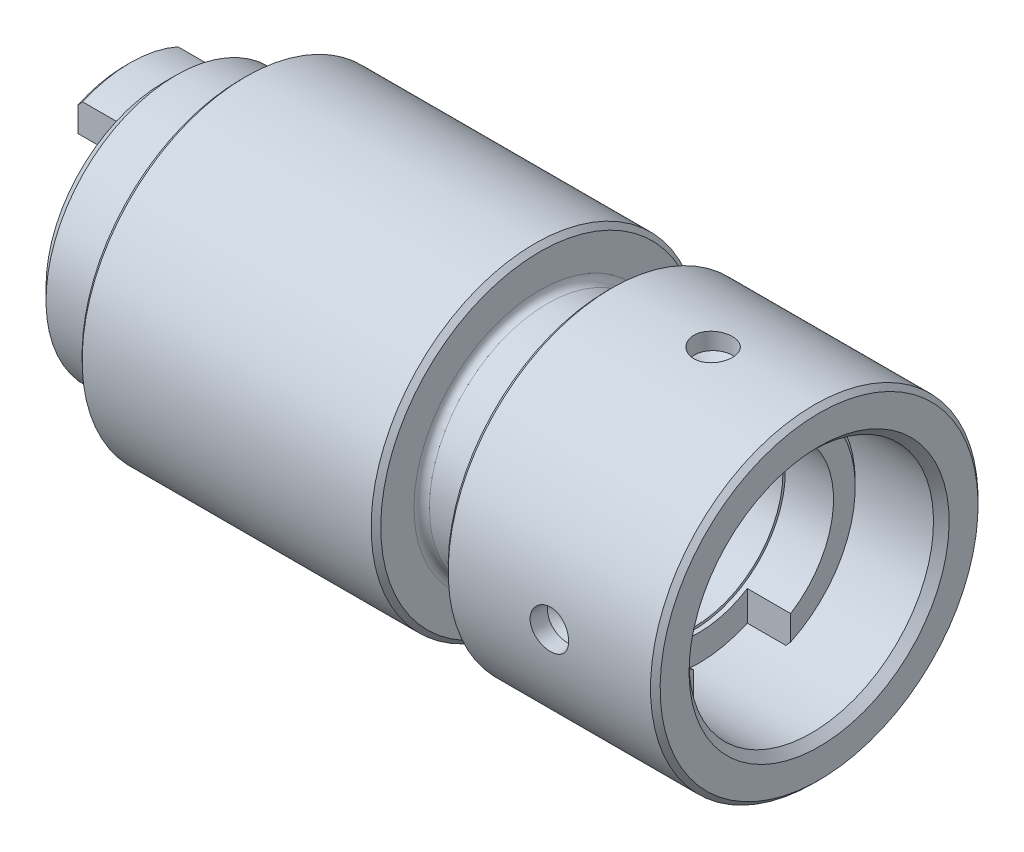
ISO-10303-21;
HEADER;
FILE_DESCRIPTION(('STEP AP214'),'2;1');
FILE_NAME('part.step','',(''),(''),'','','');
FILE_SCHEMA(('AUTOMOTIVE_DESIGN { 1 0 10303 214 1 1 1 1 }'));
ENDSEC;
DATA;
#1=APPLICATION_CONTEXT('core data for automotive mechanical design processes');
#2=APPLICATION_PROTOCOL_DEFINITION('international standard','automotive_design',2000,#1);
#3=PRODUCT_CONTEXT('',#1,'mechanical');
#4=PRODUCT('Part','Part','',(#3));
#5=PRODUCT_RELATED_PRODUCT_CATEGORY('part','',(#4));
#6=PRODUCT_DEFINITION_FORMATION('','',#4);
#7=PRODUCT_DEFINITION_CONTEXT('part definition',#1,'design');
#8=PRODUCT_DEFINITION('design','',#6,#7);
#9=PRODUCT_DEFINITION_SHAPE('','',#8);
#10=(LENGTH_UNIT() NAMED_UNIT(*) SI_UNIT(.MILLI.,.METRE.));
#11=(NAMED_UNIT(*) PLANE_ANGLE_UNIT() SI_UNIT($,.RADIAN.));
#12=(NAMED_UNIT(*) SI_UNIT($,.STERADIAN.) SOLID_ANGLE_UNIT());
#13=UNCERTAINTY_MEASURE_WITH_UNIT(LENGTH_MEASURE(1.E-05),#10,'distance_accuracy_value','');
#14=(GEOMETRIC_REPRESENTATION_CONTEXT(3) GLOBAL_UNCERTAINTY_ASSIGNED_CONTEXT((#13)) GLOBAL_UNIT_ASSIGNED_CONTEXT((#10,
#11,#12)) REPRESENTATION_CONTEXT('',''));
#15=CARTESIAN_POINT('',(0.,0.,0.));
#16=DIRECTION('',(0.,0.,1.));
#17=DIRECTION('',(1.,0.,0.));
#18=AXIS2_PLACEMENT_3D('',#15,#16,#17);
#19=CARTESIAN_POINT('',(60.,0.,0.));
#20=DIRECTION('',(1.,0.,0.));
#21=DIRECTION('',(0.,1.,0.));
#22=AXIS2_PLACEMENT_3D('',#19,#20,#21);
#23=CYLINDRICAL_SURFACE('',#22,17.);
#24=CARTESIAN_POINT('',(38.5,0.,0.));
#25=DIRECTION('',(1.,0.,0.));
#26=DIRECTION('',(0.,1.,0.));
#27=AXIS2_PLACEMENT_3D('',#24,#25,#26);
#28=CIRCLE('',#27,17.);
#29=CARTESIAN_POINT('',(38.5,17.,0.));
#30=VERTEX_POINT('',#29);
#31=EDGE_CURVE('E245',#30,#30,#28,.T.);
#32=ORIENTED_EDGE('',*,*,#31,.T.);
#33=EDGE_LOOP('',(#32));
#34=FACE_BOUND('',#33,.T.);
#35=CARTESIAN_POINT('',(51.,0.,17.));
#36=CARTESIAN_POINT('',(50.9999952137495,-0.111926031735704,16.9999985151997));
#37=CARTESIAN_POINT('',(50.9905727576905,-0.223923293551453,16.9988829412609));
#38=CARTESIAN_POINT('',(50.9531314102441,-0.44480496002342,16.9945399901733));
#39=CARTESIAN_POINT('',(50.9250927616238,-0.553685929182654,16.9913103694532));
#40=CARTESIAN_POINT('',(50.85125340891,-0.765105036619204,16.9831033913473));
#41=CARTESIAN_POINT('',(50.8054642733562,-0.867647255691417,16.9781271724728));
#42=CARTESIAN_POINT('',(50.6974481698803,-1.06357111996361,16.9669813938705));
#43=CARTESIAN_POINT('',(50.6352241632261,-1.15695441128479,16.9608120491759));
#44=CARTESIAN_POINT('',(50.4957781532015,-1.33238781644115,16.9479357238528));
#45=CARTESIAN_POINT('',(50.4184917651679,-1.4143865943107,16.9412265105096));
#46=CARTESIAN_POINT('',(50.2512529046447,-1.56428146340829,16.9280447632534));
#47=CARTESIAN_POINT('',(50.1612998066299,-1.63217685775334,16.921572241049));
#48=CARTESIAN_POINT('',(49.9709508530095,-1.7521262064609,16.9095745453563));
#49=CARTESIAN_POINT('',(49.8705247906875,-1.80413253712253,16.9040522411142));
#50=CARTESIAN_POINT('',(49.6622888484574,-1.89052338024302,16.8946092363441));
#51=CARTESIAN_POINT('',(49.5544792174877,-1.92490848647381,16.8906884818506));
#52=CARTESIAN_POINT('',(49.3350667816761,-1.97492589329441,16.8849135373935));
#53=CARTESIAN_POINT('',(49.2234838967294,-1.99064446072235,16.8830498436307));
#54=CARTESIAN_POINT('',(48.999249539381,-2.00314945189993,16.881570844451));
#55=CARTESIAN_POINT('',(48.8865981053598,-1.99993655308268,16.8819554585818));
#56=CARTESIAN_POINT('',(48.6640235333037,-1.97474071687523,16.8849209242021));
#57=CARTESIAN_POINT('',(48.5540894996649,-1.95285253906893,16.8874906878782));
#58=CARTESIAN_POINT('',(48.3394659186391,-1.89107519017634,16.8945196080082));
#59=CARTESIAN_POINT('',(48.2347764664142,-1.85118569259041,16.8989787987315));
#60=CARTESIAN_POINT('',(48.0333178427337,-1.7544353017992,16.9092967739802));
#61=CARTESIAN_POINT('',(47.9365687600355,-1.69753295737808,16.9151589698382));
#62=CARTESIAN_POINT('',(47.7539572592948,-1.56840181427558,16.927619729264));
#63=CARTESIAN_POINT('',(47.6680952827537,-1.49617239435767,16.9342183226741));
#64=CARTESIAN_POINT('',(47.5091450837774,-1.33791096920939,16.9474577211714));
#65=CARTESIAN_POINT('',(47.4361382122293,-1.2517972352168,16.9540985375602));
#66=CARTESIAN_POINT('',(47.3056031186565,-1.06849379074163,16.9666362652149));
#67=CARTESIAN_POINT('',(47.2480749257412,-0.97130405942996,16.9725331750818));
#68=CARTESIAN_POINT('',(47.150131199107,-0.768546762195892,16.9829217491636));
#69=CARTESIAN_POINT('',(47.1097204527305,-0.662976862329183,16.9874130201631));
#70=CARTESIAN_POINT('',(47.0472217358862,-0.446485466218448,16.9944805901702));
#71=CARTESIAN_POINT('',(47.0251330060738,-0.335564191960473,16.9970569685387));
#72=CARTESIAN_POINT('',(47.0000100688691,-0.112222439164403,16.9999941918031));
#73=CARTESIAN_POINT('',(46.9968637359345,0.000185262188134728,17.0003680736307));
#74=CARTESIAN_POINT('',(47.0094194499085,0.223926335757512,16.9988933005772));
#75=CARTESIAN_POINT('',(47.0251211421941,0.335259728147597,16.997044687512));
#76=CARTESIAN_POINT('',(47.0748340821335,0.553363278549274,16.9913408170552));
#77=CARTESIAN_POINT('',(47.1087921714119,0.660145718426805,16.9874913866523));
#78=CARTESIAN_POINT('',(47.1939988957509,0.866499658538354,16.978217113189));
#79=CARTESIAN_POINT('',(47.2452480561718,0.966070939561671,16.9727922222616));
#80=CARTESIAN_POINT('',(47.3638555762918,1.15567883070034,16.9609399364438));
#81=CARTESIAN_POINT('',(47.4312868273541,1.24566955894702,16.9545080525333));
#82=CARTESIAN_POINT('',(47.5802408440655,1.41309578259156,16.9413761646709));
#83=CARTESIAN_POINT('',(47.6617641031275,1.49053083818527,16.9346761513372));
#84=CARTESIAN_POINT('',(47.8370804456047,1.63104275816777,16.9217232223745));
#85=CARTESIAN_POINT('',(47.9309331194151,1.69404552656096,16.9154727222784));
#86=CARTESIAN_POINT('',(48.1279535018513,1.80339337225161,16.9041653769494));
#87=CARTESIAN_POINT('',(48.2311210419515,1.84973875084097,16.8991085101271));
#88=CARTESIAN_POINT('',(48.4435987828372,1.92433498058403,16.8907770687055));
#89=CARTESIAN_POINT('',(48.5528938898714,1.95262833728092,16.8874983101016));
#90=CARTESIAN_POINT('',(48.7747246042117,1.99045460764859,16.8830820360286));
#91=CARTESIAN_POINT('',(48.8872600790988,1.99998828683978,16.8819444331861));
#92=CARTESIAN_POINT('',(49.1116401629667,2.00001162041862,16.8819416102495));
#93=CARTESIAN_POINT('',(49.2234847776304,1.99061767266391,16.88306250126));
#94=CARTESIAN_POINT('',(49.4439941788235,1.95329812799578,16.8874205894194));
#95=CARTESIAN_POINT('',(49.5526589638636,1.92537252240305,16.8906577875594));
#96=CARTESIAN_POINT('',(49.7637132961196,1.85181744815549,16.8988795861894));
#97=CARTESIAN_POINT('',(49.8661045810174,1.80619290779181,16.9038637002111));
#98=CARTESIAN_POINT('',(50.061796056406,1.69854661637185,16.9150186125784));
#99=CARTESIAN_POINT('',(50.1550961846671,1.63652475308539,16.9211894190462));
#100=CARTESIAN_POINT('',(50.3305525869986,1.49741057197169,16.9340679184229));
#101=CARTESIAN_POINT('',(50.4126398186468,1.42023144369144,16.9407785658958));
#102=CARTESIAN_POINT('',(50.5627441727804,1.25317277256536,16.9539542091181));
#103=CARTESIAN_POINT('',(50.6307579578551,1.16329022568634,16.9604191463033));
#104=CARTESIAN_POINT('',(50.7509769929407,0.973031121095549,16.9723987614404));
#105=CARTESIAN_POINT('',(50.8031279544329,0.872620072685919,16.9779101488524));
#106=CARTESIAN_POINT('',(50.8897552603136,0.664459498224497,16.9873277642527));
#107=CARTESIAN_POINT('',(50.924251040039,0.55671819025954,16.9912357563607));
#108=CARTESIAN_POINT('',(50.9662217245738,0.373668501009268,16.9960514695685));
#109=CARTESIAN_POINT('',(50.9788706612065,0.29951979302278,16.9975250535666));
#110=CARTESIAN_POINT('',(50.9957613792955,0.150258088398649,16.9994998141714));
#111=CARTESIAN_POINT('',(51.0000032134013,0.0751450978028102,17.0000009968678));
#112=CARTESIAN_POINT('',(51.,0.,17.));
#113=B_SPLINE_CURVE_WITH_KNOTS('',3,(#35,#36,#37,#38,#39,#40,#41,#42,#43,#44,#45,#46,#47,#48,
#49,#50,#51,#52,#53,#54,#55,#56,#57,#58,#59,#60,#61,#62,#63,#64,#65,#66,#67,#68,#69,#70,#71,#72,
#73,#74,#75,#76,#77,#78,#79,#80,#81,#82,#83,#84,#85,#86,#87,#88,#89,#90,#91,#92,#93,#94,#95,#96,
#97,#98,#99,#100,#101,#102,#103,#104,#105,#106,#107,#108,#109,#110,#111,#112),.UNSPECIFIED.,.T.,
.F.,(4,2,2,2,2,2,2,2,2,2,2,2,2,2,2,2,2,2,2,2,2,2,2,2,2,2,2,2,2,2,2,2,2,2,2,2,2,2,4),(0.,
0.335503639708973,0.671363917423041,1.00700567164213,1.34258699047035,1.67963553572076,
2.01670073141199,2.35476650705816,2.6928208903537,3.02930680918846,3.3657806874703,
3.70055735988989,4.0353401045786,4.37094527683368,4.70656405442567,5.04423583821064,
5.38190825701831,5.71967505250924,6.05742784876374,6.39317940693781,6.72892464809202,
7.06369753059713,7.39848058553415,7.73480093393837,8.07113306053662,8.4091550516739,
8.74717092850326,9.08438794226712,9.42159119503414,9.75672710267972,10.0918631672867,
10.4269059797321,10.7619510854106,11.0989742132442,11.4360771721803,11.7743211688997,
12.1121920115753,12.3374444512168,12.5626954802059),.UNSPECIFIED.);
#114=CARTESIAN_POINT('',(51.,0.,17.));
#115=VERTEX_POINT('',#114);
#116=EDGE_CURVE('E27',#115,#115,#113,.T.);
#117=ORIENTED_EDGE('',*,*,#116,.T.);
#118=EDGE_LOOP('',(#117));
#119=FACE_BOUND('',#118,.T.);
#120=CARTESIAN_POINT('',(51.,17.,0.));
#121=CARTESIAN_POINT('',(50.9999952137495,16.9999985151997,0.111926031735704));
#122=CARTESIAN_POINT('',(50.9905727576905,16.9988829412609,0.223923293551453));
#123=CARTESIAN_POINT('',(50.9531314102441,16.9945399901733,0.44480496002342));
#124=CARTESIAN_POINT('',(50.9250927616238,16.9913103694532,0.553685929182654));
#125=CARTESIAN_POINT('',(50.85125340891,16.9831033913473,0.765105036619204));
#126=CARTESIAN_POINT('',(50.8054642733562,16.9781271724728,0.867647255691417));
#127=CARTESIAN_POINT('',(50.6974481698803,16.9669813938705,1.06357111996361));
#128=CARTESIAN_POINT('',(50.6352241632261,16.9608120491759,1.15695441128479));
#129=CARTESIAN_POINT('',(50.4957781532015,16.9479357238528,1.33238781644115));
#130=CARTESIAN_POINT('',(50.4184917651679,16.9412265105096,1.4143865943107));
#131=CARTESIAN_POINT('',(50.2512529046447,16.9280447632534,1.56428146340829));
#132=CARTESIAN_POINT('',(50.1612998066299,16.921572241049,1.63217685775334));
#133=CARTESIAN_POINT('',(49.9709508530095,16.9095745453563,1.7521262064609));
#134=CARTESIAN_POINT('',(49.8705247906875,16.9040522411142,1.80413253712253));
#135=CARTESIAN_POINT('',(49.6622888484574,16.8946092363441,1.89052338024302));
#136=CARTESIAN_POINT('',(49.5544792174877,16.8906884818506,1.92490848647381));
#137=CARTESIAN_POINT('',(49.3350667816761,16.8849135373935,1.9749258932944));
#138=CARTESIAN_POINT('',(49.2234838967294,16.8830498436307,1.99064446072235));
#139=CARTESIAN_POINT('',(48.9992495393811,16.881570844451,2.00314945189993));
#140=CARTESIAN_POINT('',(48.8865981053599,16.8819554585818,1.99993655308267));
#141=CARTESIAN_POINT('',(48.6640235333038,16.8849209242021,1.97474071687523));
#142=CARTESIAN_POINT('',(48.5540894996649,16.8874906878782,1.95285253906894));
#143=CARTESIAN_POINT('',(48.3394659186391,16.8945196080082,1.89107519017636));
#144=CARTESIAN_POINT('',(48.2347764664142,16.8989787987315,1.85118569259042));
#145=CARTESIAN_POINT('',(48.0333178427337,16.9092967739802,1.7544353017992));
#146=CARTESIAN_POINT('',(47.9365687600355,16.9151589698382,1.69753295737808));
#147=CARTESIAN_POINT('',(47.7539572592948,16.927619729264,1.56840181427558));
#148=CARTESIAN_POINT('',(47.6680952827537,16.9342183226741,1.49617239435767));
#149=CARTESIAN_POINT('',(47.5091450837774,16.9474577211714,1.33791096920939));
#150=CARTESIAN_POINT('',(47.4361382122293,16.9540985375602,1.2517972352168));
#151=CARTESIAN_POINT('',(47.3056031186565,16.9666362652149,1.06849379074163));
#152=CARTESIAN_POINT('',(47.2480749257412,16.9725331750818,0.97130405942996));
#153=CARTESIAN_POINT('',(47.150131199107,16.9829217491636,0.768546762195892));
#154=CARTESIAN_POINT('',(47.1097204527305,16.9874130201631,0.662976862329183));
#155=CARTESIAN_POINT('',(47.0472217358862,16.9944805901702,0.446485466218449));
#156=CARTESIAN_POINT('',(47.0251330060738,16.9970569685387,0.335564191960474));
#157=CARTESIAN_POINT('',(47.0000100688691,16.9999941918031,0.112222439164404));
#158=CARTESIAN_POINT('',(46.9968637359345,17.0003680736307,-0.000185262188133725));
#159=CARTESIAN_POINT('',(47.0094194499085,16.9988933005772,-0.223926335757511));
#160=CARTESIAN_POINT('',(47.0251211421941,16.997044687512,-0.335259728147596));
#161=CARTESIAN_POINT('',(47.0748340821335,16.9913408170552,-0.553363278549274));
#162=CARTESIAN_POINT('',(47.1087921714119,16.9874913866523,-0.660145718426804));
#163=CARTESIAN_POINT('',(47.1939988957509,16.978217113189,-0.866499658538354));
#164=CARTESIAN_POINT('',(47.2452480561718,16.9727922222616,-0.96607093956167));
#165=CARTESIAN_POINT('',(47.3638555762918,16.9609399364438,-1.15567883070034));
#166=CARTESIAN_POINT('',(47.4312868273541,16.9545080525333,-1.24566955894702));
#167=CARTESIAN_POINT('',(47.5802408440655,16.9413761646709,-1.41309578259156));
#168=CARTESIAN_POINT('',(47.6617641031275,16.9346761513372,-1.49053083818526));
#169=CARTESIAN_POINT('',(47.8370804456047,16.9217232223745,-1.63104275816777));
#170=CARTESIAN_POINT('',(47.9309331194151,16.9154727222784,-1.69404552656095));
#171=CARTESIAN_POINT('',(48.1279535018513,16.9041653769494,-1.80339337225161));
#172=CARTESIAN_POINT('',(48.2311210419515,16.8991085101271,-1.84973875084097));
#173=CARTESIAN_POINT('',(48.4435987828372,16.8907770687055,-1.92433498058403));
#174=CARTESIAN_POINT('',(48.5528938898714,16.8874983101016,-1.95262833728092));
#175=CARTESIAN_POINT('',(48.7747246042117,16.8830820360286,-1.99045460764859));
#176=CARTESIAN_POINT('',(48.8872600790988,16.8819444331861,-1.99998828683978));
#177=CARTESIAN_POINT('',(49.1116401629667,16.8819416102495,-2.00001162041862));
#178=CARTESIAN_POINT('',(49.2234847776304,16.88306250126,-1.99061767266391));
#179=CARTESIAN_POINT('',(49.4439941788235,16.8874205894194,-1.95329812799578));
#180=CARTESIAN_POINT('',(49.5526589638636,16.8906577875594,-1.92537252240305));
#181=CARTESIAN_POINT('',(49.7637132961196,16.8988795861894,-1.85181744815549));
#182=CARTESIAN_POINT('',(49.8661045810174,16.9038637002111,-1.80619290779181));
#183=CARTESIAN_POINT('',(50.061796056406,16.9150186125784,-1.69854661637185));
#184=CARTESIAN_POINT('',(50.1550961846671,16.9211894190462,-1.63652475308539));
#185=CARTESIAN_POINT('',(50.3305525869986,16.9340679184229,-1.49741057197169));
#186=CARTESIAN_POINT('',(50.4126398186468,16.9407785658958,-1.42023144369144));
#187=CARTESIAN_POINT('',(50.5627441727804,16.9539542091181,-1.25317277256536));
#188=CARTESIAN_POINT('',(50.6307579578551,16.9604191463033,-1.16329022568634));
#189=CARTESIAN_POINT('',(50.7509769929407,16.9723987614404,-0.973031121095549));
#190=CARTESIAN_POINT('',(50.8031279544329,16.9779101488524,-0.872620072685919));
#191=CARTESIAN_POINT('',(50.8897552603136,16.9873277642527,-0.664459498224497));
#192=CARTESIAN_POINT('',(50.924251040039,16.9912357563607,-0.55671819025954));
#193=CARTESIAN_POINT('',(50.9662217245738,16.9960514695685,-0.373668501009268));
#194=CARTESIAN_POINT('',(50.9788706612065,16.9975250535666,-0.29951979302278));
#195=CARTESIAN_POINT('',(50.9957613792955,16.9994998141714,-0.150258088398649));
#196=CARTESIAN_POINT('',(51.0000032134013,17.0000009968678,-0.07514509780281));
#197=CARTESIAN_POINT('',(51.,17.,0.));
#198=B_SPLINE_CURVE_WITH_KNOTS('',3,(#120,#121,#122,#123,#124,#125,#126,#127,#128,#129,#130,
#131,#132,#133,#134,#135,#136,#137,#138,#139,#140,#141,#142,#143,#144,#145,#146,#147,#148,#149,
#150,#151,#152,#153,#154,#155,#156,#157,#158,#159,#160,#161,#162,#163,#164,#165,#166,#167,#168,
#169,#170,#171,#172,#173,#174,#175,#176,#177,#178,#179,#180,#181,#182,#183,#184,#185,#186,#187,
#188,#189,#190,#191,#192,#193,#194,#195,#196,#197),.UNSPECIFIED.,.T.,.F.,(4,2,2,2,2,2,2,2,2,2,2,
2,2,2,2,2,2,2,2,2,2,2,2,2,2,2,2,2,2,2,2,2,2,2,2,2,2,2,4),(0.,0.335503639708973,
0.671363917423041,1.00700567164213,1.34258699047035,1.67963553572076,2.01670073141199,
2.35476650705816,2.6928208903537,3.02930680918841,3.3657806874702,3.70055735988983,
4.0353401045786,4.37094527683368,4.70656405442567,5.04423583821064,5.38190825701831,
5.71967505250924,6.05742784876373,6.3931794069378,6.72892464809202,7.06369753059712,
7.39848058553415,7.73480093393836,8.07113306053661,8.40915505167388,8.74717092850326,
9.08438794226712,9.42159119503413,9.75672710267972,10.0918631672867,10.4269059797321,
10.7619510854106,11.0989742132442,11.4360771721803,11.7743211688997,12.1121920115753,
12.3374444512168,12.5626954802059),.UNSPECIFIED.);
#199=CARTESIAN_POINT('',(51.,17.,0.));
#200=VERTEX_POINT('',#199);
#201=EDGE_CURVE('E205',#200,#200,#198,.T.);
#202=ORIENTED_EDGE('',*,*,#201,.T.);
#203=EDGE_LOOP('',(#202));
#204=FACE_BOUND('',#203,.T.);
#205=CARTESIAN_POINT('',(51.,-17.,0.));
#206=CARTESIAN_POINT('',(50.9999952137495,-16.9999985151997,-0.111926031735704));
#207=CARTESIAN_POINT('',(50.9905727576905,-16.9988829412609,-0.223923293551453));
#208=CARTESIAN_POINT('',(50.9531314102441,-16.9945399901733,-0.44480496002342));
#209=CARTESIAN_POINT('',(50.9250927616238,-16.9913103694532,-0.553685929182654));
#210=CARTESIAN_POINT('',(50.85125340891,-16.9831033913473,-0.765105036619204));
#211=CARTESIAN_POINT('',(50.8054642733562,-16.9781271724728,-0.867647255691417));
#212=CARTESIAN_POINT('',(50.6974481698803,-16.9669813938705,-1.06357111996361));
#213=CARTESIAN_POINT('',(50.6352241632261,-16.9608120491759,-1.15695441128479));
#214=CARTESIAN_POINT('',(50.4957781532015,-16.9479357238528,-1.33238781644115));
#215=CARTESIAN_POINT('',(50.4184917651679,-16.9412265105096,-1.4143865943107));
#216=CARTESIAN_POINT('',(50.2512529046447,-16.9280447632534,-1.56428146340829));
#217=CARTESIAN_POINT('',(50.1612998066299,-16.921572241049,-1.63217685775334));
#218=CARTESIAN_POINT('',(49.9709508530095,-16.9095745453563,-1.7521262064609));
#219=CARTESIAN_POINT('',(49.8705247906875,-16.9040522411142,-1.80413253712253));
#220=CARTESIAN_POINT('',(49.6622888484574,-16.8946092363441,-1.89052338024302));
#221=CARTESIAN_POINT('',(49.5544792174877,-16.8906884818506,-1.92490848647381));
#222=CARTESIAN_POINT('',(49.3350667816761,-16.8849135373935,-1.9749258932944));
#223=CARTESIAN_POINT('',(49.2234838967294,-16.8830498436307,-1.99064446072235));
#224=CARTESIAN_POINT('',(48.9992495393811,-16.881570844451,-2.00314945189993));
#225=CARTESIAN_POINT('',(48.8865981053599,-16.8819554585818,-1.99993655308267));
#226=CARTESIAN_POINT('',(48.6640235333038,-16.8849209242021,-1.97474071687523));
#227=CARTESIAN_POINT('',(48.5540894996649,-16.8874906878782,-1.95285253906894));
#228=CARTESIAN_POINT('',(48.3394659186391,-16.8945196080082,-1.89107519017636));
#229=CARTESIAN_POINT('',(48.2347764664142,-16.8989787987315,-1.85118569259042));
#230=CARTESIAN_POINT('',(48.0333178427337,-16.9092967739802,-1.7544353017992));
#231=CARTESIAN_POINT('',(47.9365687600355,-16.9151589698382,-1.69753295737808));
#232=CARTESIAN_POINT('',(47.7539572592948,-16.927619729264,-1.56840181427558));
#233=CARTESIAN_POINT('',(47.6680952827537,-16.9342183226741,-1.49617239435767));
#234=CARTESIAN_POINT('',(47.5091450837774,-16.9474577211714,-1.33791096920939));
#235=CARTESIAN_POINT('',(47.4361382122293,-16.9540985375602,-1.2517972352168));
#236=CARTESIAN_POINT('',(47.3056031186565,-16.9666362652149,-1.06849379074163));
#237=CARTESIAN_POINT('',(47.2480749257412,-16.9725331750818,-0.97130405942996));
#238=CARTESIAN_POINT('',(47.150131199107,-16.9829217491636,-0.768546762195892));
#239=CARTESIAN_POINT('',(47.1097204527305,-16.9874130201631,-0.662976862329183));
#240=CARTESIAN_POINT('',(47.0472217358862,-16.9944805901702,-0.446485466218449));
#241=CARTESIAN_POINT('',(47.0251330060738,-16.9970569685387,-0.335564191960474));
#242=CARTESIAN_POINT('',(47.0000100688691,-16.9999941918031,-0.112222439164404));
#243=CARTESIAN_POINT('',(46.9968637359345,-17.0003680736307,0.000185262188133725));
#244=CARTESIAN_POINT('',(47.0094194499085,-16.9988933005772,0.223926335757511));
#245=CARTESIAN_POINT('',(47.0251211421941,-16.997044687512,0.335259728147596));
#246=CARTESIAN_POINT('',(47.0748340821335,-16.9913408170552,0.553363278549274));
#247=CARTESIAN_POINT('',(47.1087921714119,-16.9874913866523,0.660145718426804));
#248=CARTESIAN_POINT('',(47.1939988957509,-16.978217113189,0.866499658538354));
#249=CARTESIAN_POINT('',(47.2452480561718,-16.9727922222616,0.96607093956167));
#250=CARTESIAN_POINT('',(47.3638555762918,-16.9609399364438,1.15567883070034));
#251=CARTESIAN_POINT('',(47.4312868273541,-16.9545080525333,1.24566955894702));
#252=CARTESIAN_POINT('',(47.5802408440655,-16.9413761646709,1.41309578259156));
#253=CARTESIAN_POINT('',(47.6617641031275,-16.9346761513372,1.49053083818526));
#254=CARTESIAN_POINT('',(47.8370804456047,-16.9217232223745,1.63104275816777));
#255=CARTESIAN_POINT('',(47.9309331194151,-16.9154727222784,1.69404552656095));
#256=CARTESIAN_POINT('',(48.1279535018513,-16.9041653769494,1.80339337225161));
#257=CARTESIAN_POINT('',(48.2311210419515,-16.8991085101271,1.84973875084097));
#258=CARTESIAN_POINT('',(48.4435987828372,-16.8907770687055,1.92433498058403));
#259=CARTESIAN_POINT('',(48.5528938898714,-16.8874983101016,1.95262833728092));
#260=CARTESIAN_POINT('',(48.7747246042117,-16.8830820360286,1.99045460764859));
#261=CARTESIAN_POINT('',(48.8872600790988,-16.8819444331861,1.99998828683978));
#262=CARTESIAN_POINT('',(49.1116401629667,-16.8819416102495,2.00001162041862));
#263=CARTESIAN_POINT('',(49.2234847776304,-16.88306250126,1.99061767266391));
#264=CARTESIAN_POINT('',(49.4439941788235,-16.8874205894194,1.95329812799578));
#265=CARTESIAN_POINT('',(49.5526589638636,-16.8906577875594,1.92537252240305));
#266=CARTESIAN_POINT('',(49.7637132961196,-16.8988795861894,1.85181744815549));
#267=CARTESIAN_POINT('',(49.8661045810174,-16.9038637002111,1.80619290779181));
#268=CARTESIAN_POINT('',(50.061796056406,-16.9150186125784,1.69854661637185));
#269=CARTESIAN_POINT('',(50.1550961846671,-16.9211894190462,1.63652475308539));
#270=CARTESIAN_POINT('',(50.3305525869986,-16.9340679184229,1.49741057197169));
#271=CARTESIAN_POINT('',(50.4126398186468,-16.9407785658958,1.42023144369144));
#272=CARTESIAN_POINT('',(50.5627441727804,-16.9539542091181,1.25317277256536));
#273=CARTESIAN_POINT('',(50.6307579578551,-16.9604191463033,1.16329022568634));
#274=CARTESIAN_POINT('',(50.7509769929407,-16.9723987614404,0.973031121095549));
#275=CARTESIAN_POINT('',(50.8031279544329,-16.9779101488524,0.872620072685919));
#276=CARTESIAN_POINT('',(50.8897552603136,-16.9873277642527,0.664459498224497));
#277=CARTESIAN_POINT('',(50.924251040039,-16.9912357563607,0.55671819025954));
#278=CARTESIAN_POINT('',(50.9662217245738,-16.9960514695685,0.373668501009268));
#279=CARTESIAN_POINT('',(50.9788706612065,-16.9975250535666,0.29951979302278));
#280=CARTESIAN_POINT('',(50.9957613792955,-16.9994998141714,0.150258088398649));
#281=CARTESIAN_POINT('',(51.0000032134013,-17.0000009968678,0.07514509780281));
#282=CARTESIAN_POINT('',(51.,-17.,0.));
#283=B_SPLINE_CURVE_WITH_KNOTS('',3,(#205,#206,#207,#208,#209,#210,#211,#212,#213,#214,#215,
#216,#217,#218,#219,#220,#221,#222,#223,#224,#225,#226,#227,#228,#229,#230,#231,#232,#233,#234,
#235,#236,#237,#238,#239,#240,#241,#242,#243,#244,#245,#246,#247,#248,#249,#250,#251,#252,#253,
#254,#255,#256,#257,#258,#259,#260,#261,#262,#263,#264,#265,#266,#267,#268,#269,#270,#271,#272,
#273,#274,#275,#276,#277,#278,#279,#280,#281,#282),.UNSPECIFIED.,.T.,.F.,(4,2,2,2,2,2,2,2,2,2,2,
2,2,2,2,2,2,2,2,2,2,2,2,2,2,2,2,2,2,2,2,2,2,2,2,2,2,2,4),(0.,0.335503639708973,
0.671363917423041,1.00700567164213,1.34258699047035,1.67963553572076,2.01670073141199,
2.35476650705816,2.6928208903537,3.02930680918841,3.3657806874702,3.70055735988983,
4.0353401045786,4.37094527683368,4.70656405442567,5.04423583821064,5.38190825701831,
5.71967505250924,6.05742784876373,6.3931794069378,6.72892464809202,7.06369753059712,
7.39848058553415,7.73480093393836,8.07113306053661,8.40915505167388,8.74717092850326,
9.08438794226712,9.42159119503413,9.75672710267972,10.0918631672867,10.4269059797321,
10.7619510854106,11.0989742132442,11.4360771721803,11.7743211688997,12.1121920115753,
12.3374444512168,12.5626954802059),.UNSPECIFIED.);
#284=CARTESIAN_POINT('',(51.,-17.,0.));
#285=VERTEX_POINT('',#284);
#286=EDGE_CURVE('E212',#285,#285,#283,.T.);
#287=ORIENTED_EDGE('',*,*,#286,.T.);
#288=EDGE_LOOP('',(#287));
#289=FACE_BOUND('',#288,.T.);
#290=CARTESIAN_POINT('',(59.5,0.,0.));
#291=DIRECTION('',(1.,0.,0.));
#292=DIRECTION('',(0.,1.,0.));
#293=AXIS2_PLACEMENT_3D('',#290,#291,#292);
#294=CIRCLE('',#293,17.);
#295=CARTESIAN_POINT('',(59.5,17.,0.));
#296=VERTEX_POINT('',#295);
#297=EDGE_CURVE('E248',#296,#296,#294,.T.);
#298=ORIENTED_EDGE('',*,*,#297,.F.);
#299=EDGE_LOOP('',(#298));
#300=FACE_BOUND('',#299,.T.);
#301=CARTESIAN_POINT('',(49.,2.,-16.8819430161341));
#302=CARTESIAN_POINT('',(48.8880769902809,1.99999521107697,-16.8819445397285));
#303=CARTESIAN_POINT('',(48.7760827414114,1.99057324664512,-16.8830680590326));
#304=CARTESIAN_POINT('',(48.5552073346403,1.95313402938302,-16.8874393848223));
#305=CARTESIAN_POINT('',(48.4463296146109,1.92509700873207,-16.8906894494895));
#306=CARTESIAN_POINT('',(48.2349173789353,1.85126241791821,-16.898940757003));
#307=CARTESIAN_POINT('',(48.1323787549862,1.80547649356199,-16.9039408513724));
#308=CARTESIAN_POINT('',(47.9364609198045,1.69746795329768,-16.9151274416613));
#309=CARTESIAN_POINT('',(47.843080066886,1.63524829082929,-16.9213137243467));
#310=CARTESIAN_POINT('',(47.6676439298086,1.49580667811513,-16.9342101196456));
#311=CARTESIAN_POINT('',(47.5856407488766,1.41851937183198,-16.9409224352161));
#312=CARTESIAN_POINT('',(47.4357373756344,1.25127682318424,-16.9540947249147));
#313=CARTESIAN_POINT('',(47.367837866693,1.16132096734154,-16.9605546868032));
#314=CARTESIAN_POINT('',(47.2478841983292,0.970969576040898,-16.972516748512));
#315=CARTESIAN_POINT('',(47.1958769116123,0.870544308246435,-16.9780159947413));
#316=CARTESIAN_POINT('',(47.1094840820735,0.662310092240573,-16.9874128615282));
#317=CARTESIAN_POINT('',(47.0750979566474,0.554501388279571,-16.9913105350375));
#318=CARTESIAN_POINT('',(47.0250784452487,0.335091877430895,-16.9970495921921));
#319=CARTESIAN_POINT('',(47.0093586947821,0.223511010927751,-16.9989004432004));
#320=CARTESIAN_POINT('',(46.9968506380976,-0.000719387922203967,-17.0003696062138));
#321=CARTESIAN_POINT('',(47.0000616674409,-0.113368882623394,-16.9999879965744));
#322=CARTESIAN_POINT('',(47.0252545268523,-0.335951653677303,-16.9970429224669));
#323=CARTESIAN_POINT('',(47.0471434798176,-0.445895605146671,-16.9944902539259));
#324=CARTESIAN_POINT('',(47.1089258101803,-0.660538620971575,-16.9875020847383));
#325=CARTESIAN_POINT('',(47.1488194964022,-0.765237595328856,-16.9830665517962));
#326=CARTESIAN_POINT('',(47.2455785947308,-0.96670782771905,-16.972792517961));
#327=CARTESIAN_POINT('',(47.3024844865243,-1.06345946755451,-16.9669506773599));
#328=CARTESIAN_POINT('',(47.4316232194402,-1.2460745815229,-16.9545182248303));
#329=CARTESIAN_POINT('',(47.5038566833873,-1.33193761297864,-16.9479275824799));
#330=CARTESIAN_POINT('',(47.6621209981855,-1.49088330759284,-16.9346886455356));
#331=CARTESIAN_POINT('',(47.748232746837,-1.56388543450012,-16.9280402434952));
#332=CARTESIAN_POINT('',(47.9315305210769,-1.69441189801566,-16.915474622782));
#333=CARTESIAN_POINT('',(48.0287165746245,-1.75193619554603,-16.9095574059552));
#334=CARTESIAN_POINT('',(48.2314728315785,-1.84987711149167,-16.8991240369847));
#335=CARTESIAN_POINT('',(48.3370459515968,-1.89028774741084,-16.8946083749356));
#336=CARTESIAN_POINT('',(48.553544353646,-1.95278525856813,-16.8874991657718));
#337=CARTESIAN_POINT('',(48.6644694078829,-1.97487291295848,-16.8849055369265));
#338=CARTESIAN_POINT('',(48.8878129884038,-1.99999178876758,-16.8819487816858));
#339=CARTESIAN_POINT('',(49.0002186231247,-2.00313613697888,-16.8815724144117));
#340=CARTESIAN_POINT('',(49.223955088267,-1.99057719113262,-16.8830578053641));
#341=CARTESIAN_POINT('',(49.3352859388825,-1.97487425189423,-16.8849195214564));
#342=CARTESIAN_POINT('',(49.5533764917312,-1.92516154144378,-16.8906592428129));
#343=CARTESIAN_POINT('',(49.6601487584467,-1.8912061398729,-16.8945312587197));
#344=CARTESIAN_POINT('',(49.8664835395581,-1.8060081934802,-16.9038504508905));
#345=CARTESIAN_POINT('',(49.9660458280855,-1.75476510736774,-16.9092976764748));
#346=CARTESIAN_POINT('',(50.1556474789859,-1.63616659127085,-16.9211853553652));
#347=CARTESIAN_POINT('',(50.2456399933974,-1.56873672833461,-16.9276303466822));
#348=CARTESIAN_POINT('',(50.4130704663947,-1.41978442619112,-16.9407729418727));
#349=CARTESIAN_POINT('',(50.4905079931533,-1.33826150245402,-16.9474705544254));
#350=CARTESIAN_POINT('',(50.6310254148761,-1.16294410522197,-16.9604042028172));
#351=CARTESIAN_POINT('',(50.6940311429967,-1.06908997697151,-16.9666377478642));
#352=CARTESIAN_POINT('',(50.8033841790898,-0.872065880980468,-16.9779039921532));
#353=CARTESIAN_POINT('',(50.8497317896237,-0.768896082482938,-16.9829367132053));
#354=CARTESIAN_POINT('',(50.9243294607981,-0.556419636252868,-16.9912231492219));
#355=CARTESIAN_POINT('',(50.9526229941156,-0.447128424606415,-16.9944811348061));
#356=CARTESIAN_POINT('',(50.9904509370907,-0.225305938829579,-16.9988686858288));
#357=CARTESIAN_POINT('',(50.9999860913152,-0.112774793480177,-16.9999983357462));
#358=CARTESIAN_POINT('',(51.0000137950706,0.111607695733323,-17.0000016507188));
#359=CARTESIAN_POINT('',(50.9906209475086,0.22345904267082,-16.9988888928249));
#360=CARTESIAN_POINT('',(50.9533012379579,0.44398218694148,-16.9945593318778));
#361=CARTESIAN_POINT('',(50.9253743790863,0.552653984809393,-16.9913425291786));
#362=CARTESIAN_POINT('',(50.8518140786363,0.763722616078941,-16.9831648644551));
#363=CARTESIAN_POINT('',(50.8061854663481,0.866121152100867,-16.9782044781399));
#364=CARTESIAN_POINT('',(50.6985287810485,1.06182543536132,-16.9670900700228));
#365=CARTESIAN_POINT('',(50.6365006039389,1.15513112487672,-16.9609360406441));
#366=CARTESIAN_POINT('',(50.4973793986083,1.33058739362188,-16.9480775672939));
#367=CARTESIAN_POINT('',(50.4202010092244,1.41267007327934,-16.9413701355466));
#368=CARTESIAN_POINT('',(50.2531456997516,1.56276558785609,-16.9281852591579));
#369=CARTESIAN_POINT('',(50.1632657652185,1.63077507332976,-16.9217078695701));
#370=CARTESIAN_POINT('',(49.9730088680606,1.75098938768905,-16.9096927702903));
#371=CARTESIAN_POINT('',(49.8725969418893,1.80313917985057,-16.9041583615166));
#372=CARTESIAN_POINT('',(49.6644345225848,1.88976405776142,-16.894694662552));
#373=CARTESIAN_POINT('',(49.5566922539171,1.92425859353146,-16.8907636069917));
#374=CARTESIAN_POINT('',(49.3736458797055,1.96622583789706,-16.8859179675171));
#375=CARTESIAN_POINT('',(49.2995016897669,1.97887322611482,-16.8844346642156));
#376=CARTESIAN_POINT('',(49.1502490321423,1.99576188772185,-16.8824466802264));
#377=CARTESIAN_POINT('',(49.0751405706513,2.00000321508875,-16.8819419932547));
#378=CARTESIAN_POINT('',(49.,2.,-16.8819430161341));
#379=B_SPLINE_CURVE_WITH_KNOTS('',3,(#301,#302,#303,#304,#305,#306,#307,#308,#309,#310,#311,
#312,#313,#314,#315,#316,#317,#318,#319,#320,#321,#322,#323,#324,#325,#326,#327,#328,#329,#330,
#331,#332,#333,#334,#335,#336,#337,#338,#339,#340,#341,#342,#343,#344,#345,#346,#347,#348,#349,
#350,#351,#352,#353,#354,#355,#356,#357,#358,#359,#360,#361,#362,#363,#364,#365,#366,#367,#368,
#369,#370,#371,#372,#373,#374,#375,#376,#377,#378),.UNSPECIFIED.,.T.,.F.,(4,2,2,2,2,2,2,2,2,2,2,
2,2,2,2,2,2,2,2,2,2,2,2,2,2,2,2,2,2,2,2,2,2,2,2,2,2,2,4),(0.,0.335494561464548,
0.671345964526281,1.00697737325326,1.3425485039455,1.679608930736,2.01668568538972,
2.35474723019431,2.69279759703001,3.0292777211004,3.36574603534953,3.70055092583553,
4.03536155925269,4.37097528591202,4.70660265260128,5.04426231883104,5.38192283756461,
5.71970129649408,6.05746539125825,6.3932103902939,6.7289490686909,7.06369316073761,
7.39844773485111,7.73477216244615,8.07110815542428,8.40913566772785,8.74715704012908,
9.08436138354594,9.4215523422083,9.75670785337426,10.0918633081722,10.4269273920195,
10.7619936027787,11.0990048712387,11.4360962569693,11.7743444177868,12.1122191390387,
12.3374580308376,12.5626954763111),.UNSPECIFIED.);
#380=CARTESIAN_POINT('',(49.,2.,-16.8819430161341));
#381=VERTEX_POINT('',#380);
#382=EDGE_CURVE('E9',#381,#381,#379,.T.);
#383=ORIENTED_EDGE('',*,*,#382,.T.);
#384=EDGE_LOOP('',(#383));
#385=FACE_BOUND('',#384,.T.);
#386=ADVANCED_FACE('F14',(#34,#119,#204,#289,#300,#385),#23,.T.);
#387=CARTESIAN_POINT('',(-12.,0.,11.75));
#388=DIRECTION('',(-1.,0.,0.));
#389=DIRECTION('',(0.,-1.,0.));
#390=AXIS2_PLACEMENT_3D('',#387,#388,#389);
#391=PLANE('',#390);
#392=DIRECTION('',(0.,-1.,0.));
#393=VECTOR('',#392,1.);
#394=CARTESIAN_POINT('',(-12.,12.5,4.95));
#395=LINE('',#394,#393);
#396=CARTESIAN_POINT('',(-12.,-8.10848321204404,4.95));
#397=VERTEX_POINT('',#396);
#398=CARTESIAN_POINT('',(-12.,-10.6564534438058,4.95));
#399=VERTEX_POINT('',#398);
#400=EDGE_CURVE('E42',#397,#399,#395,.T.);
#401=ORIENTED_EDGE('',*,*,#400,.F.);
#402=CARTESIAN_POINT('',(-12.,0.,0.));
#403=DIRECTION('',(1.,0.,0.));
#404=DIRECTION('',(0.,1.,0.));
#405=AXIS2_PLACEMENT_3D('',#402,#403,#404);
#406=CIRCLE('',#405,9.5);
#407=CARTESIAN_POINT('',(-12.,-8.10848321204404,-4.95));
#408=VERTEX_POINT('',#407);
#409=EDGE_CURVE('E452',#397,#408,#406,.T.);
#410=ORIENTED_EDGE('',*,*,#409,.T.);
#411=DIRECTION('',(0.,1.,0.));
#412=VECTOR('',#411,1.);
#413=CARTESIAN_POINT('',(-12.,-12.5,-4.95));
#414=LINE('',#413,#412);
#415=CARTESIAN_POINT('',(-12.,-10.6564534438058,-4.95));
#416=VERTEX_POINT('',#415);
#417=EDGE_CURVE('E288',#416,#408,#414,.T.);
#418=ORIENTED_EDGE('',*,*,#417,.F.);
#419=CARTESIAN_POINT('',(-12.,0.,0.));
#420=DIRECTION('',(1.,0.,0.));
#421=DIRECTION('',(0.,1.,0.));
#422=AXIS2_PLACEMENT_3D('',#419,#420,#421);
#423=CIRCLE('',#422,11.75);
#424=EDGE_CURVE('E378',#399,#416,#423,.T.);
#425=ORIENTED_EDGE('',*,*,#424,.F.);
#426=EDGE_LOOP('',(#401,#410,#418,#425));
#427=FACE_BOUND('',#426,.T.);
#428=ADVANCED_FACE('F184',(#427),#391,.T.);
#429=CARTESIAN_POINT('',(52.,0.,0.));
#430=DIRECTION('',(1.,0.,0.));
#431=DIRECTION('',(0.,1.,0.));
#432=AXIS2_PLACEMENT_3D('',#429,#430,#431);
#433=CYLINDRICAL_SURFACE('',#432,9.5);
#434=DIRECTION('',(1.,0.,0.));
#435=VECTOR('',#434,1.);
#436=CARTESIAN_POINT('',(52.,-8.10848321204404,4.95));
#437=LINE('',#436,#435);
#438=CARTESIAN_POINT('',(-8.,-8.10848321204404,4.95));
#439=VERTEX_POINT('',#438);
#440=EDGE_CURVE('E302',#439,#397,#437,.F.);
#441=ORIENTED_EDGE('',*,*,#440,.F.);
#442=CARTESIAN_POINT('',(-8.,0.,0.));
#443=DIRECTION('',(1.,0.,0.));
#444=DIRECTION('',(0.,1.,0.));
#445=AXIS2_PLACEMENT_3D('',#442,#443,#444);
#446=CIRCLE('',#445,9.5);
#447=CARTESIAN_POINT('',(-8.,-8.10848321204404,-4.95));
#448=VERTEX_POINT('',#447);
#449=EDGE_CURVE('E448',#439,#448,#446,.T.);
#450=ORIENTED_EDGE('',*,*,#449,.T.);
#451=DIRECTION('',(1.,0.,0.));
#452=VECTOR('',#451,1.);
#453=CARTESIAN_POINT('',(52.,-8.10848321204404,-4.95));
#454=LINE('',#453,#452);
#455=EDGE_CURVE('E296',#408,#448,#454,.T.);
#456=ORIENTED_EDGE('',*,*,#455,.F.);
#457=ORIENTED_EDGE('',*,*,#409,.F.);
#458=EDGE_LOOP('',(#441,#450,#456,#457));
#459=FACE_BOUND('',#458,.T.);
#460=ADVANCED_FACE('F190',(#459),#433,.F.);
#461=CARTESIAN_POINT('',(52.,0.,0.));
#462=DIRECTION('',(1.,0.,0.));
#463=DIRECTION('',(0.,1.,0.));
#464=AXIS2_PLACEMENT_3D('',#461,#462,#463);
#465=CYLINDRICAL_SURFACE('',#464,12.25);
#466=DIRECTION('',(1.,0.,0.));
#467=VECTOR('',#466,1.);
#468=CARTESIAN_POINT('',(52.,-11.2053558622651,4.95));
#469=LINE('',#468,#467);
#470=CARTESIAN_POINT('',(-11.5,-11.2053558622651,4.95));
#471=VERTEX_POINT('',#470);
#472=CARTESIAN_POINT('',(-8.,-11.2053558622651,4.95));
#473=VERTEX_POINT('',#472);
#474=EDGE_CURVE('E298',#471,#473,#469,.T.);
#475=ORIENTED_EDGE('',*,*,#474,.F.);
#476=CARTESIAN_POINT('',(-11.5,0.,0.));
#477=DIRECTION('',(1.,0.,0.));
#478=DIRECTION('',(0.,1.,0.));
#479=AXIS2_PLACEMENT_3D('',#476,#477,#478);
#480=CIRCLE('',#479,12.25);
#481=CARTESIAN_POINT('',(-11.5,-11.2053558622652,-4.95));
#482=VERTEX_POINT('',#481);
#483=EDGE_CURVE('E382',#471,#482,#480,.T.);
#484=ORIENTED_EDGE('',*,*,#483,.T.);
#485=DIRECTION('',(1.,0.,0.));
#486=VECTOR('',#485,1.);
#487=CARTESIAN_POINT('',(52.,-11.2053558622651,-4.95));
#488=LINE('',#487,#486);
#489=CARTESIAN_POINT('',(-8.,-11.2053558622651,-4.95));
#490=VERTEX_POINT('',#489);
#491=EDGE_CURVE('E292',#490,#482,#488,.F.);
#492=ORIENTED_EDGE('',*,*,#491,.F.);
#493=CARTESIAN_POINT('',(-8.,0.,0.));
#494=DIRECTION('',(1.,0.,0.));
#495=DIRECTION('',(0.,1.,0.));
#496=AXIS2_PLACEMENT_3D('',#493,#494,#495);
#497=CIRCLE('',#496,12.25);
#498=EDGE_CURVE('E387',#473,#490,#497,.T.);
#499=ORIENTED_EDGE('',*,*,#498,.F.);
#500=EDGE_LOOP('',(#475,#484,#492,#499));
#501=FACE_BOUND('',#500,.T.);
#502=ADVANCED_FACE('F493',(#501),#465,.T.);
#503=CARTESIAN_POINT('',(-11.5,0.,0.));
#504=DIRECTION('',(1.,0.,0.));
#505=DIRECTION('',(0.,1.,0.));
#506=AXIS2_PLACEMENT_3D('',#503,#504,#505);
#507=CONICAL_SURFACE('',#506,12.25,0.785398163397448);
#508=CARTESIAN_POINT('',(3.2032609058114,26.4948254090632,4.95));
#509=CARTESIAN_POINT('',(2.51381405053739,25.7934123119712,4.95));
#510=CARTESIAN_POINT('',(1.82480125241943,25.0915713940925,4.95));
#511=CARTESIAN_POINT('',(0.447152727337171,23.6858558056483,4.95));
#512=CARTESIAN_POINT('',(-0.241481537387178,22.981979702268,4.95));
#513=CARTESIAN_POINT('',(-1.63178185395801,21.5577677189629,4.95));
#514=CARTESIAN_POINT('',(-2.33341459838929,20.8373993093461,4.95));
#515=CARTESIAN_POINT('',(-3.73364260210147,19.3954075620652,4.95));
#516=CARTESIAN_POINT('',(-4.43224050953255,18.6737867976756,4.95));
#517=CARTESIAN_POINT('',(-5.70449622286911,17.3540438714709,4.95));
#518=CARTESIAN_POINT('',(-6.27864062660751,16.7563911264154,4.95));
#519=CARTESIAN_POINT('',(-7.42418169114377,15.558299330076,4.95));
#520=CARTESIAN_POINT('',(-7.99557796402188,14.9578599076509,4.95));
#521=CARTESIAN_POINT('',(-9.13703721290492,13.750467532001,4.95));
#522=CARTESIAN_POINT('',(-9.7070819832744,13.1434973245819,4.95));
#523=CARTESIAN_POINT('',(-10.5575651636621,12.2290725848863,4.95));
#524=CARTESIAN_POINT('',(-10.8402227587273,11.9236825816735,4.95));
#525=CARTESIAN_POINT('',(-11.4036901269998,11.3112036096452,4.95));
#526=CARTESIAN_POINT('',(-11.6844999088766,11.0041146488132,4.95));
#527=CARTESIAN_POINT('',(-12.2386008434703,10.3935530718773,4.95));
#528=CARTESIAN_POINT('',(-12.511934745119,10.0901192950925,4.95));
#529=CARTESIAN_POINT('',(-13.0557524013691,9.48068414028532,4.95));
#530=CARTESIAN_POINT('',(-13.3262360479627,9.17468266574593,4.95));
#531=CARTESIAN_POINT('',(-13.864026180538,8.55877296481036,4.95));
#532=CARTESIAN_POINT('',(-14.1313249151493,8.24885795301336,4.95));
#533=CARTESIAN_POINT('',(-14.6608555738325,7.62478406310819,4.95));
#534=CARTESIAN_POINT('',(-14.9230881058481,7.31062570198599,4.95));
#535=CARTESIAN_POINT('',(-15.4383054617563,6.67943613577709,4.95));
#536=CARTESIAN_POINT('',(-15.691351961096,6.36245564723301,4.95));
#537=CARTESIAN_POINT('',(-16.063615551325,5.88117802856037,4.95));
#538=CARTESIAN_POINT('',(-16.1865214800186,5.71973505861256,4.95));
#539=CARTESIAN_POINT('',(-16.4293129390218,5.39459735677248,4.95));
#540=CARTESIAN_POINT('',(-16.5491985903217,5.23090271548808,4.95));
#541=CARTESIAN_POINT('',(-16.7848409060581,4.90144336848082,4.95));
#542=CARTESIAN_POINT('',(-16.9006107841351,4.7356881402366,4.95));
#543=CARTESIAN_POINT('',(-17.1275768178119,4.40103606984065,4.95));
#544=CARTESIAN_POINT('',(-17.2387725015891,4.23213890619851,4.95));
#545=CARTESIAN_POINT('',(-17.455258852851,3.89084287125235,4.95));
#546=CARTESIAN_POINT('',(-17.5605557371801,3.71844795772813,4.95));
#547=CARTESIAN_POINT('',(-17.7637613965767,3.3693763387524,4.95));
#548=CARTESIAN_POINT('',(-17.8616724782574,3.19270099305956,4.95));
#549=CARTESIAN_POINT('',(-17.9750571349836,2.9746536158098,4.95));
#550=CARTESIAN_POINT('',(-17.9950675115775,2.93562401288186,4.95));
#551=CARTESIAN_POINT('',(-18.034614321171,2.85731987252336,4.95));
#552=CARTESIAN_POINT('',(-18.0541507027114,2.81804530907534,4.95));
#553=CARTESIAN_POINT('',(-18.1120142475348,2.69983458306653,4.95));
#554=CARTESIAN_POINT('',(-18.1495874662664,2.62052738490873,4.95));
#555=CARTESIAN_POINT('',(-18.2224864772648,2.46088367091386,4.95));
#556=CARTESIAN_POINT('',(-18.257812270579,2.38054715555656,4.95));
#557=CARTESIAN_POINT('',(-18.325952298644,2.21882193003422,4.95));
#558=CARTESIAN_POINT('',(-18.3587666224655,2.13743325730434,4.95));
#559=CARTESIAN_POINT('',(-18.4523269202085,1.89347198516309,4.95));
#560=CARTESIAN_POINT('',(-18.5090216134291,1.72930986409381,4.95));
#561=CARTESIAN_POINT('',(-18.6091069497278,1.39691062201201,4.95));
#562=CARTESIAN_POINT('',(-18.6524970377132,1.22867333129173,4.95));
#563=CARTESIAN_POINT('',(-18.7178372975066,0.916284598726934,4.95));
#564=CARTESIAN_POINT('',(-18.7421164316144,0.772623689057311,4.95));
#565=CARTESIAN_POINT('',(-18.778476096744,0.483789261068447,4.95));
#566=CARTESIAN_POINT('',(-18.7905607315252,0.33861626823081,4.95));
#567=CARTESIAN_POINT('',(-18.8018909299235,0.0480543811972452,4.95));
#568=CARTESIAN_POINT('',(-18.8011622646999,-0.0973334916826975,4.95));
#569=CARTESIAN_POINT('',(-18.7869727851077,-0.387503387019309,4.95));
#570=CARTESIAN_POINT('',(-18.7735091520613,-0.532285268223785,4.95));
#571=CARTESIAN_POINT('',(-18.729822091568,-0.855001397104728,4.95));
#572=CARTESIAN_POINT('',(-18.6963352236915,-1.03249370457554,4.95));
#573=CARTESIAN_POINT('',(-18.6130909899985,-1.38365906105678,4.95));
#574=CARTESIAN_POINT('',(-18.5633238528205,-1.55732974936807,4.95));
#575=CARTESIAN_POINT('',(-18.4783589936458,-1.8150335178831,4.95));
#576=CARTESIAN_POINT('',(-18.4481897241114,-1.90077407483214,4.95));
#577=CARTESIAN_POINT('',(-18.3847787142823,-2.07107213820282,4.95));
#578=CARTESIAN_POINT('',(-18.3515383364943,-2.15563015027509,4.95));
#579=CARTESIAN_POINT('',(-18.2823016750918,-2.32359220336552,4.95));
#580=CARTESIAN_POINT('',(-18.246305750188,-2.40699639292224,4.95));
#581=CARTESIAN_POINT('',(-18.1718449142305,-2.57270085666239,4.95));
#582=CARTESIAN_POINT('',(-18.133379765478,-2.65500102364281,4.95));
#583=CARTESIAN_POINT('',(-18.0132493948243,-2.9032862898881,4.95));
#584=CARTESIAN_POINT('',(-17.9281269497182,-3.06760427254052,4.95));
#585=CARTESIAN_POINT('',(-17.7506773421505,-3.39232358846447,4.95));
#586=CARTESIAN_POINT('',(-17.658347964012,-3.55272369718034,4.95));
#587=CARTESIAN_POINT('',(-17.4678667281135,-3.87025164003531,4.95));
#588=CARTESIAN_POINT('',(-17.3697086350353,-4.02737571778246,4.95));
#589=CARTESIAN_POINT('',(-17.1688084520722,-4.33862926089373,4.95));
#590=CARTESIAN_POINT('',(-17.0660668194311,-4.49275902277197,4.95));
#591=CARTESIAN_POINT('',(-16.8564338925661,-4.79909155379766,4.95));
#592=CARTESIAN_POINT('',(-16.7495273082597,-4.95128382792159,4.95));
#593=CARTESIAN_POINT('',(-16.5326365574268,-5.2534633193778,4.95));
#594=CARTESIAN_POINT('',(-16.4226522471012,-5.40345043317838,4.95));
#595=CARTESIAN_POINT('',(-16.0890489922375,-5.85039720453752,4.95));
#596=CARTESIAN_POINT('',(-15.8616473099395,-6.14453283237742,4.95));
#597=CARTESIAN_POINT('',(-15.3966029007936,-6.73119776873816,4.95));
#598=CARTESIAN_POINT('',(-15.1588620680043,-7.02364868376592,4.95));
#599=CARTESIAN_POINT('',(-14.6780696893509,-7.60420077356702,4.95));
#600=CARTESIAN_POINT('',(-14.4350175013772,-7.89230141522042,4.95));
#601=CARTESIAN_POINT('',(-13.9456035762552,-8.46436849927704,4.95));
#602=CARTESIAN_POINT('',(-13.6992521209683,-8.74834376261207,4.95));
#603=CARTESIAN_POINT('',(-13.2035415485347,-9.3136303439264,4.95));
#604=CARTESIAN_POINT('',(-12.9541825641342,-9.59494177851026,4.95));
#605=CARTESIAN_POINT('',(-12.3745237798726,-10.2433504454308,4.95));
#606=CARTESIAN_POINT('',(-12.0433671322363,-10.6096809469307,4.95));
#607=CARTESIAN_POINT('',(-11.3780152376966,-11.3395747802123,4.95));
#608=CARTESIAN_POINT('',(-11.0438199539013,-11.7031380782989,4.95));
#609=CARTESIAN_POINT('',(-10.373083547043,-12.4281263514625,4.95));
#610=CARTESIAN_POINT('',(-10.0365423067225,-12.789551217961,4.95));
#611=CARTESIAN_POINT('',(-9.36163066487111,-13.5106898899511,4.95));
#612=CARTESIAN_POINT('',(-9.02326025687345,-13.870403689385,4.95));
#613=CARTESIAN_POINT('',(-8.00515322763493,-14.9483738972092,4.95));
#614=CARTESIAN_POINT('',(-7.3232417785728,-15.664575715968,4.95));
#615=CARTESIAN_POINT('',(-5.95560480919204,-17.0932835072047,4.95));
#616=CARTESIAN_POINT('',(-5.26987939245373,-17.8057895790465,4.95));
#617=CARTESIAN_POINT('',(-3.93689092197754,-19.1855819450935,4.95));
#618=CARTESIAN_POINT('',(-3.28978485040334,-19.8530199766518,4.95));
#619=CARTESIAN_POINT('',(-1.99379718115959,-21.1861801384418,4.95));
#620=CARTESIAN_POINT('',(-1.34491556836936,-21.8519022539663,4.95));
#621=CARTESIAN_POINT('',(-0.0467417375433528,-23.1810775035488,4.95));
#622=CARTESIAN_POINT('',(0.602548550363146,-23.8445325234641,4.95));
#623=CARTESIAN_POINT('',(1.90218259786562,-25.1703951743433,4.95));
#624=CARTESIAN_POINT('',(2.55252634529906,-25.8328028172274,4.95));
#625=CARTESIAN_POINT('',(3.2032609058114,-26.4948254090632,4.95));
#626=B_SPLINE_CURVE_WITH_KNOTS('',3,(#508,#509,#510,#511,#512,#513,#514,#515,#516,#517,#518,
#519,#520,#521,#522,#523,#524,#525,#526,#527,#528,#529,#530,#531,#532,#533,#534,#535,#536,#537,
#538,#539,#540,#541,#542,#543,#544,#545,#546,#547,#548,#549,#550,#551,#552,#553,#554,#555,#556,
#557,#558,#559,#560,#561,#562,#563,#564,#565,#566,#567,#568,#569,#570,#571,#572,#573,#574,#575,
#576,#577,#578,#579,#580,#581,#582,#583,#584,#585,#586,#587,#588,#589,#590,#591,#592,#593,#594,
#595,#596,#597,#598,#599,#600,#601,#602,#603,#604,#605,#606,#607,#608,#609,#610,#611,#612,#613,
#614,#615,#616,#617,#618,#619,#620,#621,#622,#623,#624,#625),.UNSPECIFIED.,.F.,.F.,(4,2,2,2,2,2,
2,2,2,2,2,2,2,2,2,2,2,2,2,2,2,2,2,2,2,2,2,2,2,2,2,2,2,2,2,2,2,2,2,2,2,2,2,2,2,2,2,2,2,2,2,2,2,2,
2,2,2,2,4),(0.,2.95056977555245,5.90470569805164,8.92148419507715,11.9346122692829,
14.4208626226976,16.9074541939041,19.4054771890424,20.6538405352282,21.9021980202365,
23.1273580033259,24.3525642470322,25.5803111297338,26.8079097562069,28.0245445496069,
28.6332271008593,29.2418852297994,29.848370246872,30.4549176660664,31.0608133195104,
31.6665189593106,31.7980976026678,31.9296904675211,32.1929303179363,32.456170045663,
32.7194004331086,33.2399398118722,33.7605009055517,34.1971225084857,34.6335971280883,
35.0691939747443,35.5048872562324,36.0458505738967,36.5871391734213,36.8597718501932,
37.1322841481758,37.4047610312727,37.6772641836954,38.2321818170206,38.7872707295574,
39.34296454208,39.898603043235,40.4565202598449,41.0144635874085,42.1296545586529,
43.260259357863,44.3910016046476,45.5187955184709,46.646539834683,48.1279894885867,
49.6094571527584,51.0909994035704,52.5725468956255,55.5392597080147,58.5058923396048,
61.2947905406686,64.0837125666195,66.8686267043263,69.6535089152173),.UNSPECIFIED.);
#627=EDGE_CURVE('E476',#399,#471,#626,.T.);
#628=ORIENTED_EDGE('',*,*,#627,.F.);
#629=ORIENTED_EDGE('',*,*,#424,.T.);
#630=CARTESIAN_POINT('',(3.2032609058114,-26.4948254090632,-4.95));
#631=CARTESIAN_POINT('',(2.51381405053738,-25.7934123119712,-4.95));
#632=CARTESIAN_POINT('',(1.82480125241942,-25.0915713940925,-4.95));
#633=CARTESIAN_POINT('',(0.447152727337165,-23.6858558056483,-4.95));
#634=CARTESIAN_POINT('',(-0.241481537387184,-22.981979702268,-4.95));
#635=CARTESIAN_POINT('',(-1.63178185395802,-21.5577677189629,-4.95));
#636=CARTESIAN_POINT('',(-2.3334145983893,-20.837399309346,-4.95));
#637=CARTESIAN_POINT('',(-3.73364260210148,-19.3954075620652,-4.95));
#638=CARTESIAN_POINT('',(-4.43224050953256,-18.6737867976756,-4.95));
#639=CARTESIAN_POINT('',(-5.70449622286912,-17.3540438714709,-4.95));
#640=CARTESIAN_POINT('',(-6.27864062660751,-16.7563911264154,-4.95));
#641=CARTESIAN_POINT('',(-7.42418169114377,-15.558299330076,-4.95));
#642=CARTESIAN_POINT('',(-7.99557796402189,-14.9578599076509,-4.95));
#643=CARTESIAN_POINT('',(-9.13703721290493,-13.750467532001,-4.95));
#644=CARTESIAN_POINT('',(-9.70708198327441,-13.1434973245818,-4.95));
#645=CARTESIAN_POINT('',(-10.5575651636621,-12.2290725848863,-4.95));
#646=CARTESIAN_POINT('',(-10.8402227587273,-11.9236825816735,-4.95));
#647=CARTESIAN_POINT('',(-11.4036901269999,-11.3112036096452,-4.95));
#648=CARTESIAN_POINT('',(-11.6844999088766,-11.0041146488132,-4.95));
#649=CARTESIAN_POINT('',(-12.2386008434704,-10.3935530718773,-4.95));
#650=CARTESIAN_POINT('',(-12.511934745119,-10.0901192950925,-4.95));
#651=CARTESIAN_POINT('',(-13.0557524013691,-9.48068414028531,-4.95));
#652=CARTESIAN_POINT('',(-13.3262360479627,-9.17468266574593,-4.95));
#653=CARTESIAN_POINT('',(-13.864026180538,-8.55877296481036,-4.95));
#654=CARTESIAN_POINT('',(-14.1313249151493,-8.24885795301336,-4.95));
#655=CARTESIAN_POINT('',(-14.6608555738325,-7.62478406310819,-4.95));
#656=CARTESIAN_POINT('',(-14.9230881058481,-7.31062570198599,-4.95));
#657=CARTESIAN_POINT('',(-15.4383054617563,-6.67943613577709,-4.95));
#658=CARTESIAN_POINT('',(-15.691351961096,-6.36245564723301,-4.95));
#659=CARTESIAN_POINT('',(-16.063615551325,-5.88117802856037,-4.95));
#660=CARTESIAN_POINT('',(-16.1865214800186,-5.71973505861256,-4.95));
#661=CARTESIAN_POINT('',(-16.4293129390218,-5.39459735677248,-4.95));
#662=CARTESIAN_POINT('',(-16.5491985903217,-5.23090271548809,-4.95));
#663=CARTESIAN_POINT('',(-16.7848409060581,-4.90144336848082,-4.95));
#664=CARTESIAN_POINT('',(-16.9006107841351,-4.7356881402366,-4.95));
#665=CARTESIAN_POINT('',(-17.1275768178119,-4.40103606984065,-4.95));
#666=CARTESIAN_POINT('',(-17.2387725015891,-4.23213890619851,-4.95));
#667=CARTESIAN_POINT('',(-17.455258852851,-3.89084287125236,-4.95));
#668=CARTESIAN_POINT('',(-17.5605557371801,-3.71844795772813,-4.95));
#669=CARTESIAN_POINT('',(-17.7637613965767,-3.3693763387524,-4.95));
#670=CARTESIAN_POINT('',(-17.8616724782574,-3.19270099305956,-4.95));
#671=CARTESIAN_POINT('',(-17.9750571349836,-2.9746536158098,-4.95));
#672=CARTESIAN_POINT('',(-17.9950675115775,-2.93562401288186,-4.95));
#673=CARTESIAN_POINT('',(-18.034614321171,-2.85731987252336,-4.95));
#674=CARTESIAN_POINT('',(-18.0541507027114,-2.81804530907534,-4.95));
#675=CARTESIAN_POINT('',(-18.1120142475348,-2.69983458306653,-4.95));
#676=CARTESIAN_POINT('',(-18.1495874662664,-2.62052738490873,-4.95));
#677=CARTESIAN_POINT('',(-18.2224864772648,-2.46088367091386,-4.95));
#678=CARTESIAN_POINT('',(-18.257812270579,-2.38054715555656,-4.95));
#679=CARTESIAN_POINT('',(-18.325952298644,-2.21882193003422,-4.95));
#680=CARTESIAN_POINT('',(-18.3587666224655,-2.13743325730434,-4.95));
#681=CARTESIAN_POINT('',(-18.4523269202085,-1.89347198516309,-4.95));
#682=CARTESIAN_POINT('',(-18.5090216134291,-1.72930986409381,-4.95));
#683=CARTESIAN_POINT('',(-18.6091069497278,-1.39691062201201,-4.95));
#684=CARTESIAN_POINT('',(-18.6524970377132,-1.22867333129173,-4.95));
#685=CARTESIAN_POINT('',(-18.7178372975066,-0.916284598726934,-4.95));
#686=CARTESIAN_POINT('',(-18.7421164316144,-0.772623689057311,-4.95));
#687=CARTESIAN_POINT('',(-18.778476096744,-0.483789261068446,-4.95));
#688=CARTESIAN_POINT('',(-18.7905607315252,-0.338616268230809,-4.95));
#689=CARTESIAN_POINT('',(-18.8018909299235,-0.0480543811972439,-4.95));
#690=CARTESIAN_POINT('',(-18.8011622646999,0.0973334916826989,-4.95));
#691=CARTESIAN_POINT('',(-18.7869727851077,0.387503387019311,-4.95));
#692=CARTESIAN_POINT('',(-18.7735091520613,0.532285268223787,-4.95));
#693=CARTESIAN_POINT('',(-18.729822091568,0.85500139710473,-4.95));
#694=CARTESIAN_POINT('',(-18.6963352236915,1.03249370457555,-4.95));
#695=CARTESIAN_POINT('',(-18.6130909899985,1.38365906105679,-4.95));
#696=CARTESIAN_POINT('',(-18.5633238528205,1.55732974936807,-4.95));
#697=CARTESIAN_POINT('',(-18.4783589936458,1.8150335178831,-4.95));
#698=CARTESIAN_POINT('',(-18.4481897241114,1.90077407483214,-4.95));
#699=CARTESIAN_POINT('',(-18.3847787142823,2.07107213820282,-4.95));
#700=CARTESIAN_POINT('',(-18.3515383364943,2.15563015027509,-4.95));
#701=CARTESIAN_POINT('',(-18.2823016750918,2.32359220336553,-4.95));
#702=CARTESIAN_POINT('',(-18.246305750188,2.40699639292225,-4.95));
#703=CARTESIAN_POINT('',(-18.1718449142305,2.5727008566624,-4.95));
#704=CARTESIAN_POINT('',(-18.133379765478,2.65500102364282,-4.95));
#705=CARTESIAN_POINT('',(-18.0132493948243,2.90328628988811,-4.95));
#706=CARTESIAN_POINT('',(-17.9281269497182,3.06760427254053,-4.95));
#707=CARTESIAN_POINT('',(-17.7506773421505,3.39232358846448,-4.95));
#708=CARTESIAN_POINT('',(-17.658347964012,3.55272369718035,-4.95));
#709=CARTESIAN_POINT('',(-17.4678667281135,3.87025164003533,-4.95));
#710=CARTESIAN_POINT('',(-17.3697086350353,4.02737571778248,-4.95));
#711=CARTESIAN_POINT('',(-17.1688084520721,4.33862926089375,-4.95));
#712=CARTESIAN_POINT('',(-17.0660668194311,4.492759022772,-4.95));
#713=CARTESIAN_POINT('',(-16.8564338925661,4.79909155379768,-4.95));
#714=CARTESIAN_POINT('',(-16.7495273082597,4.95128382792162,-4.95));
#715=CARTESIAN_POINT('',(-16.5326365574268,5.25346331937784,-4.95));
#716=CARTESIAN_POINT('',(-16.4226522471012,5.40345043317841,-4.95));
#717=CARTESIAN_POINT('',(-16.0890489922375,5.85039720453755,-4.95));
#718=CARTESIAN_POINT('',(-15.8616473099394,6.14453283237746,-4.95));
#719=CARTESIAN_POINT('',(-15.3966029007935,6.73119776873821,-4.95));
#720=CARTESIAN_POINT('',(-15.1588620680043,7.02364868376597,-4.95));
#721=CARTESIAN_POINT('',(-14.6780696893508,7.60420077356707,-4.95));
#722=CARTESIAN_POINT('',(-14.4350175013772,7.89230141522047,-4.95));
#723=CARTESIAN_POINT('',(-13.9456035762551,8.4643684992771,-4.95));
#724=CARTESIAN_POINT('',(-13.6992521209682,8.74834376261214,-4.95));
#725=CARTESIAN_POINT('',(-13.2035415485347,9.31363034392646,-4.95));
#726=CARTESIAN_POINT('',(-12.9541825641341,9.5949417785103,-4.95));
#727=CARTESIAN_POINT('',(-12.3745237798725,10.2433504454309,-4.95));
#728=CARTESIAN_POINT('',(-12.0433671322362,10.6096809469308,-4.95));
#729=CARTESIAN_POINT('',(-11.3780152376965,11.3395747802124,-4.95));
#730=CARTESIAN_POINT('',(-11.0438199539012,11.703138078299,-4.95));
#731=CARTESIAN_POINT('',(-10.373083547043,12.4281263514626,-4.95));
#732=CARTESIAN_POINT('',(-10.0365423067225,12.7895512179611,-4.95));
#733=CARTESIAN_POINT('',(-9.36163066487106,13.5106898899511,-4.95));
#734=CARTESIAN_POINT('',(-9.02326025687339,13.870403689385,-4.95));
#735=CARTESIAN_POINT('',(-8.00515322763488,14.9483738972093,-4.95));
#736=CARTESIAN_POINT('',(-7.32324177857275,15.664575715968,-4.95));
#737=CARTESIAN_POINT('',(-5.955604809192,17.0932835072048,-4.95));
#738=CARTESIAN_POINT('',(-5.26987939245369,17.8057895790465,-4.95));
#739=CARTESIAN_POINT('',(-3.9368909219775,19.1855819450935,-4.95));
#740=CARTESIAN_POINT('',(-3.28978485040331,19.8530199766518,-4.95));
#741=CARTESIAN_POINT('',(-1.99379718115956,21.1861801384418,-4.95));
#742=CARTESIAN_POINT('',(-1.34491556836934,21.8519022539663,-4.95));
#743=CARTESIAN_POINT('',(-0.046741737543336,23.1810775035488,-4.95));
#744=CARTESIAN_POINT('',(0.60254855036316,23.8445325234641,-4.95));
#745=CARTESIAN_POINT('',(1.90218259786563,25.1703951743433,-4.95));
#746=CARTESIAN_POINT('',(2.55252634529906,25.8328028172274,-4.95));
#747=CARTESIAN_POINT('',(3.2032609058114,26.4948254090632,-4.95));
#748=B_SPLINE_CURVE_WITH_KNOTS('',3,(#630,#631,#632,#633,#634,#635,#636,#637,#638,#639,#640,
#641,#642,#643,#644,#645,#646,#647,#648,#649,#650,#651,#652,#653,#654,#655,#656,#657,#658,#659,
#660,#661,#662,#663,#664,#665,#666,#667,#668,#669,#670,#671,#672,#673,#674,#675,#676,#677,#678,
#679,#680,#681,#682,#683,#684,#685,#686,#687,#688,#689,#690,#691,#692,#693,#694,#695,#696,#697,
#698,#699,#700,#701,#702,#703,#704,#705,#706,#707,#708,#709,#710,#711,#712,#713,#714,#715,#716,
#717,#718,#719,#720,#721,#722,#723,#724,#725,#726,#727,#728,#729,#730,#731,#732,#733,#734,#735,
#736,#737,#738,#739,#740,#741,#742,#743,#744,#745,#746,#747),.UNSPECIFIED.,.F.,.F.,(4,2,2,2,2,2,
2,2,2,2,2,2,2,2,2,2,2,2,2,2,2,2,2,2,2,2,2,2,2,2,2,2,2,2,2,2,2,2,2,2,2,2,2,2,2,2,2,2,2,2,2,2,2,2,
2,2,2,2,4),(0.,2.95056977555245,5.90470569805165,8.92148419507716,11.9346122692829,
14.4208626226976,16.9074541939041,19.4054771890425,20.6538405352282,21.9021980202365,
23.1273580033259,24.3525642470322,25.5803111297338,26.8079097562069,28.0245445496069,
28.6332271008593,29.2418852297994,29.848370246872,30.4549176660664,31.0608133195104,
31.6665189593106,31.7980976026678,31.9296904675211,32.1929303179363,32.456170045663,
32.7194004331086,33.2399398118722,33.7605009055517,34.1971225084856,34.6335971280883,
35.0691939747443,35.5048872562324,36.0458505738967,36.5871391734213,36.8597718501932,
37.1322841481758,37.4047610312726,37.6772641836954,38.2321818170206,38.7872707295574,
39.3429645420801,39.898603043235,40.4565202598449,41.0144635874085,42.129654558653,
43.260259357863,44.3910016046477,45.518795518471,46.6465398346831,48.1279894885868,
49.6094571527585,51.0909994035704,52.5725468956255,55.5392597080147,58.5058923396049,
61.2947905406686,64.0837125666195,66.8686267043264,69.6535089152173),.UNSPECIFIED.);
#749=EDGE_CURVE('E475',#482,#416,#748,.T.);
#750=ORIENTED_EDGE('',*,*,#749,.F.);
#751=ORIENTED_EDGE('',*,*,#483,.F.);
#752=EDGE_LOOP('',(#628,#629,#750,#751));
#753=FACE_BOUND('',#752,.T.);
#754=ADVANCED_FACE('F487',(#753),#507,.T.);
#755=CARTESIAN_POINT('',(52.,0.,0.));
#756=DIRECTION('',(1.,0.,0.));
#757=DIRECTION('',(0.,1.,0.));
#758=AXIS2_PLACEMENT_3D('',#755,#756,#757);
#759=CYLINDRICAL_SURFACE('',#758,9.5);
#760=DIRECTION('',(1.,0.,0.));
#761=VECTOR('',#760,1.);
#762=CARTESIAN_POINT('',(52.,8.04658312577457,5.05));
#763=LINE('',#762,#761);
#764=CARTESIAN_POINT('',(47.5,8.04658312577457,5.05));
#765=VERTEX_POINT('',#764);
#766=CARTESIAN_POINT('',(52.,8.04658312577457,5.05));
#767=VERTEX_POINT('',#766);
#768=EDGE_CURVE('E364',#765,#767,#763,.T.);
#769=ORIENTED_EDGE('',*,*,#768,.T.);
#770=CARTESIAN_POINT('',(52.,0.,0.));
#771=DIRECTION('',(1.,0.,0.));
#772=DIRECTION('',(0.,1.,0.));
#773=AXIS2_PLACEMENT_3D('',#770,#771,#772);
#774=CIRCLE('',#773,9.5);
#775=CARTESIAN_POINT('',(52.,-8.04658312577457,5.05));
#776=VERTEX_POINT('',#775);
#777=EDGE_CURVE('E433',#767,#776,#774,.T.);
#778=ORIENTED_EDGE('',*,*,#777,.T.);
#779=DIRECTION('',(1.,0.,0.));
#780=VECTOR('',#779,1.);
#781=CARTESIAN_POINT('',(52.,-8.04658312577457,5.05));
#782=LINE('',#781,#780);
#783=CARTESIAN_POINT('',(47.5,-8.04658312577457,5.05));
#784=VERTEX_POINT('',#783);
#785=EDGE_CURVE('E330',#776,#784,#782,.F.);
#786=ORIENTED_EDGE('',*,*,#785,.T.);
#787=CARTESIAN_POINT('',(47.5,0.,0.));
#788=DIRECTION('',(1.,0.,0.));
#789=DIRECTION('',(0.,1.,0.));
#790=AXIS2_PLACEMENT_3D('',#787,#788,#789);
#791=CIRCLE('',#790,9.5);
#792=CARTESIAN_POINT('',(47.5,-8.04658312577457,-5.05));
#793=VERTEX_POINT('',#792);
#794=EDGE_CURVE('E374',#784,#793,#791,.T.);
#795=ORIENTED_EDGE('',*,*,#794,.T.);
#796=DIRECTION('',(1.,0.,0.));
#797=VECTOR('',#796,1.);
#798=CARTESIAN_POINT('',(52.,-8.04658312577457,-5.05));
#799=LINE('',#798,#797);
#800=CARTESIAN_POINT('',(52.,-8.04658312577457,-5.05));
#801=VERTEX_POINT('',#800);
#802=EDGE_CURVE('E368',#793,#801,#799,.T.);
#803=ORIENTED_EDGE('',*,*,#802,.T.);
#804=CARTESIAN_POINT('',(52.,8.04658312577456,-5.05));
#805=VERTEX_POINT('',#804);
#806=EDGE_CURVE('E432',#801,#805,#774,.T.);
#807=ORIENTED_EDGE('',*,*,#806,.T.);
#808=DIRECTION('',(1.,0.,0.));
#809=VECTOR('',#808,1.);
#810=CARTESIAN_POINT('',(52.,8.04658312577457,-5.05));
#811=LINE('',#810,#809);
#812=CARTESIAN_POINT('',(47.5,8.04658312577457,-5.05));
#813=VERTEX_POINT('',#812);
#814=EDGE_CURVE('E365',#805,#813,#811,.F.);
#815=ORIENTED_EDGE('',*,*,#814,.T.);
#816=EDGE_CURVE('E371',#813,#765,#791,.T.);
#817=ORIENTED_EDGE('',*,*,#816,.T.);
#818=EDGE_LOOP('',(#769,#778,#786,#795,#803,#807,#815,#817));
#819=FACE_BOUND('',#818,.T.);
#820=CARTESIAN_POINT('',(47.,0.,0.));
#821=DIRECTION('',(1.,0.,0.));
#822=DIRECTION('',(0.,1.,0.));
#823=AXIS2_PLACEMENT_3D('',#820,#821,#822);
#824=CIRCLE('',#823,9.5);
#825=CARTESIAN_POINT('',(47.,9.5,0.));
#826=VERTEX_POINT('',#825);
#827=EDGE_CURVE('E436',#826,#826,#824,.T.);
#828=ORIENTED_EDGE('',*,*,#827,.F.);
#829=EDGE_LOOP('',(#828));
#830=FACE_BOUND('',#829,.T.);
#831=ADVANCED_FACE('F571',(#819,#830),#759,.F.);
#832=CARTESIAN_POINT('',(52.,0.,9.5));
#833=DIRECTION('',(1.,0.,0.));
#834=DIRECTION('',(0.,1.,0.));
#835=AXIS2_PLACEMENT_3D('',#832,#833,#834);
#836=PLANE('',#835);
#837=CARTESIAN_POINT('',(52.,0.,0.));
#838=DIRECTION('',(1.,0.,0.));
#839=DIRECTION('',(0.,1.,0.));
#840=AXIS2_PLACEMENT_3D('',#837,#838,#839);
#841=CIRCLE('',#840,11.75);
#842=CARTESIAN_POINT('',(52.,-10.6094297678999,-5.05));
#843=VERTEX_POINT('',#842);
#844=CARTESIAN_POINT('',(52.,10.6094297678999,-5.05));
#845=VERTEX_POINT('',#844);
#846=EDGE_CURVE('E428',#843,#845,#841,.T.);
#847=ORIENTED_EDGE('',*,*,#846,.T.);
#848=DIRECTION('',(0.,1.,0.));
#849=VECTOR('',#848,1.);
#850=CARTESIAN_POINT('',(52.,-12.5,-5.05));
#851=LINE('',#850,#849);
#852=EDGE_CURVE('E313',#805,#845,#851,.T.);
#853=ORIENTED_EDGE('',*,*,#852,.F.);
#854=ORIENTED_EDGE('',*,*,#806,.F.);
#855=EDGE_CURVE('E315',#843,#801,#851,.T.);
#856=ORIENTED_EDGE('',*,*,#855,.F.);
#857=EDGE_LOOP('',(#847,#853,#854,#856));
#858=FACE_BOUND('',#857,.T.);
#859=ADVANCED_FACE('F578',(#858),#836,.T.);
#860=ORIENTED_EDGE('',*,*,#777,.F.);
#861=DIRECTION('',(0.,1.,0.));
#862=VECTOR('',#861,1.);
#863=CARTESIAN_POINT('',(52.,-12.5,5.05));
#864=LINE('',#863,#862);
#865=CARTESIAN_POINT('',(52.,10.6094297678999,5.05));
#866=VERTEX_POINT('',#865);
#867=EDGE_CURVE('E309',#767,#866,#864,.T.);
#868=ORIENTED_EDGE('',*,*,#867,.T.);
#869=CARTESIAN_POINT('',(52.,-10.6094297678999,5.05));
#870=VERTEX_POINT('',#869);
#871=EDGE_CURVE('E429',#866,#870,#841,.T.);
#872=ORIENTED_EDGE('',*,*,#871,.T.);
#873=EDGE_CURVE('E312',#870,#776,#864,.T.);
#874=ORIENTED_EDGE('',*,*,#873,.T.);
#875=EDGE_LOOP('',(#860,#868,#872,#874));
#876=FACE_BOUND('',#875,.T.);
#877=ADVANCED_FACE('F595',(#876),#836,.T.);
#878=CARTESIAN_POINT('',(52.,0.,0.));
#879=DIRECTION('',(-1.,0.,0.));
#880=DIRECTION('',(0.,-1.,0.));
#881=AXIS2_PLACEMENT_3D('',#878,#879,#880);
#882=CONICAL_SURFACE('',#881,11.75,0.785398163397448);
#883=CARTESIAN_POINT('',(51.5,0.,0.));
#884=DIRECTION('',(1.,0.,0.));
#885=DIRECTION('',(0.,1.,0.));
#886=AXIS2_PLACEMENT_3D('',#883,#884,#885);
#887=CIRCLE('',#886,12.25);
#888=CARTESIAN_POINT('',(51.5,-11.160645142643,-5.05));
#889=VERTEX_POINT('',#888);
#890=CARTESIAN_POINT('',(51.5,11.160645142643,-5.05));
#891=VERTEX_POINT('',#890);
#892=EDGE_CURVE('E424',#889,#891,#887,.T.);
#893=ORIENTED_EDGE('',*,*,#892,.T.);
#894=CARTESIAN_POINT('',(36.7967390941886,26.4759470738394,-5.05));
#895=CARTESIAN_POINT('',(37.4741166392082,25.7863220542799,-5.05));
#896=CARTESIAN_POINT('',(38.1510557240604,25.096265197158,-5.05));
#897=CARTESIAN_POINT('',(39.5045977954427,23.7140705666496,-5.05));
#898=CARTESIAN_POINT('',(40.1811992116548,23.0219312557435,-5.05));
#899=CARTESIAN_POINT('',(41.5480728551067,21.6205322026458,-5.05));
#900=CARTESIAN_POINT('',(42.2383097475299,20.9112379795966,-5.05));
#901=CARTESIAN_POINT('',(43.6157098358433,19.491456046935,-5.05));
#902=CARTESIAN_POINT('',(44.3028758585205,18.780971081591,-5.05));
#903=CARTESIAN_POINT('',(45.5697645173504,17.4655328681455,-5.05));
#904=CARTESIAN_POINT('',(46.1499108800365,16.8609880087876,-5.05));
#905=CARTESIAN_POINT('',(47.3073412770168,15.6489901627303,-5.05));
#906=CARTESIAN_POINT('',(47.8846248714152,15.0415367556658,-5.05));
#907=CARTESIAN_POINT('',(49.0379389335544,13.8196761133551,-5.05));
#908=CARTESIAN_POINT('',(49.613948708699,13.2052492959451,-5.05));
#909=CARTESIAN_POINT('',(50.4731498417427,12.2794659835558,-5.05));
#910=CARTESIAN_POINT('',(50.7586677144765,11.9702692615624,-5.05));
#911=CARTESIAN_POINT('',(51.3277635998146,11.3500968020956,-5.05));
#912=CARTESIAN_POINT('',(51.6113416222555,11.039121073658,-5.05));
#913=CARTESIAN_POINT('',(52.170384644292,10.4212264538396,-5.05));
#914=CARTESIAN_POINT('',(52.4458981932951,10.1143515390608,-5.05));
#915=CARTESIAN_POINT('',(52.9939336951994,9.49791546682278,-5.05));
#916=CARTESIAN_POINT('',(53.2664555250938,9.18835419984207,-5.05));
#917=CARTESIAN_POINT('',(53.8081850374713,8.56510485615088,-5.05));
#918=CARTESIAN_POINT('',(54.0773838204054,8.25140902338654,-5.05));
#919=CARTESIAN_POINT('',(54.6104392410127,7.619570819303,-5.05));
#920=CARTESIAN_POINT('',(54.8742965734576,7.3014290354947,-5.05));
#921=CARTESIAN_POINT('',(55.3921487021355,6.6622885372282,-5.05));
#922=CARTESIAN_POINT('',(55.6462145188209,6.34134781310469,-5.05));
#923=CARTESIAN_POINT('',(56.019589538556,5.85385066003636,-5.05));
#924=CARTESIAN_POINT('',(56.1427995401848,5.69028289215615,-5.05));
#925=CARTESIAN_POINT('',(56.3860208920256,5.36079025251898,-5.05));
#926=CARTESIAN_POINT('',(56.5060323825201,5.19486548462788,-5.05));
#927=CARTESIAN_POINT('',(56.7416644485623,4.86088639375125,-5.05));
#928=CARTESIAN_POINT('',(56.8573003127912,4.6928428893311,-5.05));
#929=CARTESIAN_POINT('',(57.0837214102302,4.35347635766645,-5.05));
#930=CARTESIAN_POINT('',(57.1945061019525,4.18215296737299,-5.05));
#931=CARTESIAN_POINT('',(57.4098059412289,3.83587471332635,-5.05));
#932=CARTESIAN_POINT('',(57.514328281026,3.66092433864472,-5.05));
#933=CARTESIAN_POINT('',(57.7155333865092,3.30659277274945,-5.05));
#934=CARTESIAN_POINT('',(57.8122188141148,3.12721311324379,-5.05));
#935=CARTESIAN_POINT('',(57.9236204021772,2.90608699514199,-5.05));
#936=CARTESIAN_POINT('',(57.9431467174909,2.86674543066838,-5.05));
#937=CARTESIAN_POINT('',(57.9817052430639,2.78781486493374,-5.05));
#938=CARTESIAN_POINT('',(58.0007373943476,2.74822583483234,-5.05));
#939=CARTESIAN_POINT('',(58.0570574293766,2.6290676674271,-5.05));
#940=CARTESIAN_POINT('',(58.093559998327,2.54912505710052,-5.05));
#941=CARTESIAN_POINT('',(58.1642288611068,2.38821342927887,-5.05));
#942=CARTESIAN_POINT('',(58.198395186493,2.30724442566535,-5.05));
#943=CARTESIAN_POINT('',(58.2641284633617,2.14425916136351,-5.05));
#944=CARTESIAN_POINT('',(58.2956955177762,2.06224294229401,-5.05));
#945=CARTESIAN_POINT('',(58.3555834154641,1.89815472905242,-5.05));
#946=CARTESIAN_POINT('',(58.3839389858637,1.81609547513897,-5.05));
#947=CARTESIAN_POINT('',(58.4375507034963,1.65097568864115,-5.05));
#948=CARTESIAN_POINT('',(58.4628068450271,1.56791515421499,-5.05));
#949=CARTESIAN_POINT('',(58.5334859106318,1.31726248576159,-5.05));
#950=CARTESIAN_POINT('',(58.5738257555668,1.14818240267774,-5.05));
#951=CARTESIAN_POINT('',(58.6339394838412,0.831891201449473,-5.05));
#952=CARTESIAN_POINT('',(58.6558546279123,0.685086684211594,-5.05));
#953=CARTESIAN_POINT('',(58.6870707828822,0.390164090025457,-5.05));
#954=CARTESIAN_POINT('',(58.6963760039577,0.242046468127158,-5.05));
#955=CARTESIAN_POINT('',(58.70187856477,-0.0542677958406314,-5.05));
#956=CARTESIAN_POINT('',(58.6980907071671,-0.20246415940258,-5.05));
#957=CARTESIAN_POINT('',(58.6776501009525,-0.497981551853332,-5.05));
#958=CARTESIAN_POINT('',(58.660994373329,-0.645302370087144,-5.05));
#959=CARTESIAN_POINT('',(58.6093473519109,-0.978738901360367,-5.05));
#960=CARTESIAN_POINT('',(58.5705482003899,-1.16426453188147,-5.05));
#961=CARTESIAN_POINT('',(58.4760123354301,-1.53098995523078,-5.05));
#962=CARTESIAN_POINT('',(58.420264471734,-1.71218681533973,-5.05));
#963=CARTESIAN_POINT('',(58.3260528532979,-1.98085953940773,-5.05));
#964=CARTESIAN_POINT('',(58.292751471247,-2.07019745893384,-5.05));
#965=CARTESIAN_POINT('',(58.2230161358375,-2.24759842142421,-5.05));
#966=CARTESIAN_POINT('',(58.1865836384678,-2.33566203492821,-5.05));
#967=CARTESIAN_POINT('',(58.1109201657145,-2.51056547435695,-5.05));
#968=CARTESIAN_POINT('',(58.0716893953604,-2.59740538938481,-5.05));
#969=CARTESIAN_POINT('',(57.9907313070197,-2.7699235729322,-5.05));
#970=CARTESIAN_POINT('',(57.9490036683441,-2.85560169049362,-5.05));
#971=CARTESIAN_POINT('',(57.8351440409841,-3.08186828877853,-5.05));
#972=CARTESIAN_POINT('',(57.7610760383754,-3.22148402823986,-5.05));
#973=CARTESIAN_POINT('',(57.6079360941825,-3.49795543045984,-5.05));
#974=CARTESIAN_POINT('',(57.5288632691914,-3.63481060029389,-5.05));
#975=CARTESIAN_POINT('',(57.3665476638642,-3.9061220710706,-5.05));
#976=CARTESIAN_POINT('',(57.2833025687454,-4.04057698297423,-5.05));
#977=CARTESIAN_POINT('',(57.1133744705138,-4.30730134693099,-5.05));
#978=CARTESIAN_POINT('',(57.0266912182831,-4.4395706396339,-5.05));
#979=CARTESIAN_POINT('',(56.7619137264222,-4.83415964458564,-5.05));
#980=CARTESIAN_POINT('',(56.5795040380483,-5.09358417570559,-5.05));
#981=CARTESIAN_POINT('',(56.2065920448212,-5.60636762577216,-5.05));
#982=CARTESIAN_POINT('',(56.0160922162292,-5.85972836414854,-5.05));
#983=CARTESIAN_POINT('',(55.6273305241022,-6.36406172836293,-5.05));
#984=CARTESIAN_POINT('',(55.4290141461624,-6.61499219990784,-5.05));
#985=CARTESIAN_POINT('',(55.0277574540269,-7.11314074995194,-5.05));
#986=CARTESIAN_POINT('',(54.8248168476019,-7.36035859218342,-5.05));
#987=CARTESIAN_POINT('',(54.4157221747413,-7.85141038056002,-5.05));
#988=CARTESIAN_POINT('',(54.209574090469,-8.0952493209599,-5.05));
#989=CARTESIAN_POINT('',(53.7944903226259,-8.58052665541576,-5.05));
#990=CARTESIAN_POINT('',(53.5855547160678,-8.82196511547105,-5.05));
#991=CARTESIAN_POINT('',(53.0365212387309,-9.45049985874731,-5.05));
#992=CARTESIAN_POINT('',(52.6946363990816,-9.83603424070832,-5.05));
#993=CARTESIAN_POINT('',(52.00669670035,-10.6033691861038,-5.05));
#994=CARTESIAN_POINT('',(51.660641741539,-10.9851696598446,-5.05));
#995=CARTESIAN_POINT('',(50.9653949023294,-11.7459555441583,-5.05));
#996=CARTESIAN_POINT('',(50.6162027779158,-12.1249407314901,-5.05));
#997=CARTESIAN_POINT('',(49.9154385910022,-12.8807059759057,-5.05));
#998=CARTESIAN_POINT('',(49.5638665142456,-13.2574860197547,-5.05));
#999=CARTESIAN_POINT('',(48.8585103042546,-14.0096768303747,-5.05));
#1000=CARTESIAN_POINT('',(48.5047243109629,-14.3850858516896,-5.05));
#1001=CARTESIAN_POINT('',(47.7956643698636,-15.134496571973,-5.05));
#1002=CARTESIAN_POINT('',(47.4403904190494,-15.508498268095,-5.05));
#1003=CARTESIAN_POINT('',(46.3728131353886,-16.6287599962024,-5.05));
#1004=CARTESIAN_POINT('',(45.6587195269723,-17.3733137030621,-5.05));
#1005=CARTESIAN_POINT('',(44.2677197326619,-18.8173291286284,-5.05));
#1006=CARTESIAN_POINT('',(43.5909913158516,-19.5169623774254,-5.05));
#1007=CARTESIAN_POINT('',(42.2354160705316,-20.9141929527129,-5.05));
#1008=CARTESIAN_POINT('',(41.5565692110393,-21.6117902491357,-5.05));
#1009=CARTESIAN_POINT('',(40.1982378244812,-23.0044924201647,-5.05));
#1010=CARTESIAN_POINT('',(39.5187554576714,-23.6995994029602,-5.05));
#1011=CARTESIAN_POINT('',(38.1585761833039,-25.0885987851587,-5.05));
#1012=CARTESIAN_POINT('',(37.4778792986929,-25.7824912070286,-5.05));
#1013=CARTESIAN_POINT('',(36.7967390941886,-26.4759470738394,-5.05));
#1014=B_SPLINE_CURVE_WITH_KNOTS('',3,(#894,#895,#896,#897,#898,#899,#900,#901,#902,#903,#904,
#905,#906,#907,#908,#909,#910,#911,#912,#913,#914,#915,#916,#917,#918,#919,#920,#921,#922,#923,
#924,#925,#926,#927,#928,#929,#930,#931,#932,#933,#934,#935,#936,#937,#938,#939,#940,#941,#942,
#943,#944,#945,#946,#947,#948,#949,#950,#951,#952,#953,#954,#955,#956,#957,#958,#959,#960,#961,
#962,#963,#964,#965,#966,#967,#968,#969,#970,#971,#972,#973,#974,#975,#976,#977,#978,#979,#980,
#981,#982,#983,#984,#985,#986,#987,#988,#989,#990,#991,#992,#993,#994,#995,#996,#997,#998,#999,
#1000,#1001,#1002,#1003,#1004,#1005,#1006,#1007,#1008,#1009,#1010,#1011,#1012,#1013),
.UNSPECIFIED.,.F.,.F.,(4,2,2,2,2,2,2,2,2,2,2,2,2,2,2,2,2,2,2,2,2,2,2,2,2,2,2,2,2,2,2,2,2,2,2,2,
2,2,2,2,2,2,2,2,2,2,2,2,2,2,2,2,2,2,2,2,2,2,2,4),(0.,2.89996778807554,5.80369079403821,
8.77281649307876,11.7380881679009,14.2517231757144,16.765733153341,19.2923113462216,
20.5548848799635,21.8174520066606,23.0546592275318,24.2919171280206,25.5319760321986,
26.7718725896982,27.999694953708,28.6140072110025,29.2282924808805,29.8401839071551,
30.4521434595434,31.0633861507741,31.6744203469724,31.8061803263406,31.9379559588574,
32.2015663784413,32.4651732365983,32.7287696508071,32.989169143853,33.2495691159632,
33.770315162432,34.2151202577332,34.6597768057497,35.1039308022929,35.5481876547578,
36.1158398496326,36.6838663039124,36.9698467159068,37.2556948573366,37.5415220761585,
37.8273860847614,38.3013892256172,38.7754762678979,39.2498293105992,39.7242167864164,
40.6753656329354,41.6262254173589,42.5856619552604,43.5451592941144,44.5030420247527,
45.4608983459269,47.0067162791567,48.5525712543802,50.0985475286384,51.6445330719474,
53.1920641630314,54.739598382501,57.8345142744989,60.7546177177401,63.6747640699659,
66.5908951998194,69.5069718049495),.UNSPECIFIED.);
#1015=EDGE_CURVE('E356',#891,#845,#1014,.T.);
#1016=ORIENTED_EDGE('',*,*,#1015,.T.);
#1017=ORIENTED_EDGE('',*,*,#846,.F.);
#1018=EDGE_CURVE('E363',#843,#889,#1014,.T.);
#1019=ORIENTED_EDGE('',*,*,#1018,.T.);
#1020=EDGE_LOOP('',(#893,#1016,#1017,#1019));
#1021=FACE_BOUND('',#1020,.T.);
#1022=ADVANCED_FACE('F332',(#1021),#882,.T.);
#1023=ORIENTED_EDGE('',*,*,#871,.F.);
#1024=CARTESIAN_POINT('',(36.7967390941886,-26.4759470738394,5.05));
#1025=CARTESIAN_POINT('',(37.4741166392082,-25.7863220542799,5.05));
#1026=CARTESIAN_POINT('',(38.1510557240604,-25.096265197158,5.05));
#1027=CARTESIAN_POINT('',(39.5045977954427,-23.7140705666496,5.05));
#1028=CARTESIAN_POINT('',(40.1811992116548,-23.0219312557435,5.05));
#1029=CARTESIAN_POINT('',(41.5480728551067,-21.6205322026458,5.05));
#1030=CARTESIAN_POINT('',(42.2383097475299,-20.9112379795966,5.05));
#1031=CARTESIAN_POINT('',(43.6157098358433,-19.491456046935,5.05));
#1032=CARTESIAN_POINT('',(44.3028758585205,-18.780971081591,5.05));
#1033=CARTESIAN_POINT('',(45.5697645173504,-17.4655328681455,5.05));
#1034=CARTESIAN_POINT('',(46.1499108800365,-16.8609880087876,5.05));
#1035=CARTESIAN_POINT('',(47.3073412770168,-15.6489901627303,5.05));
#1036=CARTESIAN_POINT('',(47.8846248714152,-15.0415367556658,5.05));
#1037=CARTESIAN_POINT('',(49.0379389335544,-13.8196761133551,5.05));
#1038=CARTESIAN_POINT('',(49.613948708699,-13.2052492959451,5.05));
#1039=CARTESIAN_POINT('',(50.4731498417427,-12.2794659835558,5.05));
#1040=CARTESIAN_POINT('',(50.7586677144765,-11.9702692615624,5.05));
#1041=CARTESIAN_POINT('',(51.3277635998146,-11.3500968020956,5.05));
#1042=CARTESIAN_POINT('',(51.6113416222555,-11.039121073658,5.05));
#1043=CARTESIAN_POINT('',(52.170384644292,-10.4212264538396,5.05));
#1044=CARTESIAN_POINT('',(52.4458981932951,-10.1143515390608,5.05));
#1045=CARTESIAN_POINT('',(52.9939336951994,-9.49791546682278,5.05));
#1046=CARTESIAN_POINT('',(53.2664555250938,-9.18835419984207,5.05));
#1047=CARTESIAN_POINT('',(53.8081850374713,-8.56510485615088,5.05));
#1048=CARTESIAN_POINT('',(54.0773838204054,-8.25140902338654,5.05));
#1049=CARTESIAN_POINT('',(54.6104392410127,-7.619570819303,5.05));
#1050=CARTESIAN_POINT('',(54.8742965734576,-7.3014290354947,5.05));
#1051=CARTESIAN_POINT('',(55.3921487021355,-6.6622885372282,5.05));
#1052=CARTESIAN_POINT('',(55.6462145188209,-6.34134781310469,5.05));
#1053=CARTESIAN_POINT('',(56.019589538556,-5.85385066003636,5.05));
#1054=CARTESIAN_POINT('',(56.1427995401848,-5.69028289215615,5.05));
#1055=CARTESIAN_POINT('',(56.3860208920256,-5.36079025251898,5.05));
#1056=CARTESIAN_POINT('',(56.5060323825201,-5.19486548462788,5.05));
#1057=CARTESIAN_POINT('',(56.7416644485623,-4.86088639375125,5.05));
#1058=CARTESIAN_POINT('',(56.8573003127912,-4.6928428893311,5.05));
#1059=CARTESIAN_POINT('',(57.0837214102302,-4.35347635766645,5.05));
#1060=CARTESIAN_POINT('',(57.1945061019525,-4.18215296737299,5.05));
#1061=CARTESIAN_POINT('',(57.4098059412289,-3.83587471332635,5.05));
#1062=CARTESIAN_POINT('',(57.514328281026,-3.66092433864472,5.05));
#1063=CARTESIAN_POINT('',(57.7155333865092,-3.30659277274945,5.05));
#1064=CARTESIAN_POINT('',(57.8122188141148,-3.12721311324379,5.05));
#1065=CARTESIAN_POINT('',(57.9236204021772,-2.90608699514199,5.05));
#1066=CARTESIAN_POINT('',(57.9431467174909,-2.86674543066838,5.05));
#1067=CARTESIAN_POINT('',(57.9817052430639,-2.78781486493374,5.05));
#1068=CARTESIAN_POINT('',(58.0007373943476,-2.74822583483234,5.05));
#1069=CARTESIAN_POINT('',(58.0570574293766,-2.6290676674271,5.05));
#1070=CARTESIAN_POINT('',(58.093559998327,-2.54912505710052,5.05));
#1071=CARTESIAN_POINT('',(58.1642288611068,-2.38821342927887,5.05));
#1072=CARTESIAN_POINT('',(58.198395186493,-2.30724442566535,5.05));
#1073=CARTESIAN_POINT('',(58.2641284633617,-2.14425916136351,5.05));
#1074=CARTESIAN_POINT('',(58.2956955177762,-2.06224294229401,5.05));
#1075=CARTESIAN_POINT('',(58.3555834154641,-1.89815472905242,5.05));
#1076=CARTESIAN_POINT('',(58.3839389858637,-1.81609547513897,5.05));
#1077=CARTESIAN_POINT('',(58.4375507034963,-1.65097568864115,5.05));
#1078=CARTESIAN_POINT('',(58.4628068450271,-1.56791515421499,5.05));
#1079=CARTESIAN_POINT('',(58.5334859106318,-1.31726248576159,5.05));
#1080=CARTESIAN_POINT('',(58.5738257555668,-1.14818240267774,5.05));
#1081=CARTESIAN_POINT('',(58.6339394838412,-0.831891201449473,5.05));
#1082=CARTESIAN_POINT('',(58.6558546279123,-0.685086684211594,5.05));
#1083=CARTESIAN_POINT('',(58.6870707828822,-0.390164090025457,5.05));
#1084=CARTESIAN_POINT('',(58.6963760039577,-0.242046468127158,5.05));
#1085=CARTESIAN_POINT('',(58.70187856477,0.0542677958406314,5.05));
#1086=CARTESIAN_POINT('',(58.6980907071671,0.20246415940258,5.05));
#1087=CARTESIAN_POINT('',(58.6776501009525,0.497981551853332,5.05));
#1088=CARTESIAN_POINT('',(58.660994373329,0.645302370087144,5.05));
#1089=CARTESIAN_POINT('',(58.6093473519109,0.978738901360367,5.05));
#1090=CARTESIAN_POINT('',(58.5705482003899,1.16426453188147,5.05));
#1091=CARTESIAN_POINT('',(58.4760123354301,1.53098995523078,5.05));
#1092=CARTESIAN_POINT('',(58.420264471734,1.71218681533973,5.05));
#1093=CARTESIAN_POINT('',(58.3260528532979,1.98085953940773,5.05));
#1094=CARTESIAN_POINT('',(58.292751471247,2.07019745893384,5.05));
#1095=CARTESIAN_POINT('',(58.2230161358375,2.24759842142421,5.05));
#1096=CARTESIAN_POINT('',(58.1865836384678,2.33566203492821,5.05));
#1097=CARTESIAN_POINT('',(58.1109201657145,2.51056547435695,5.05));
#1098=CARTESIAN_POINT('',(58.0716893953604,2.59740538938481,5.05));
#1099=CARTESIAN_POINT('',(57.9907313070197,2.7699235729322,5.05));
#1100=CARTESIAN_POINT('',(57.9490036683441,2.85560169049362,5.05));
#1101=CARTESIAN_POINT('',(57.8351440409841,3.08186828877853,5.05));
#1102=CARTESIAN_POINT('',(57.7610760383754,3.22148402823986,5.05));
#1103=CARTESIAN_POINT('',(57.6079360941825,3.49795543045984,5.05));
#1104=CARTESIAN_POINT('',(57.5288632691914,3.63481060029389,5.05));
#1105=CARTESIAN_POINT('',(57.3665476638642,3.9061220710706,5.05));
#1106=CARTESIAN_POINT('',(57.2833025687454,4.04057698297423,5.05));
#1107=CARTESIAN_POINT('',(57.1133744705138,4.30730134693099,5.05));
#1108=CARTESIAN_POINT('',(57.0266912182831,4.4395706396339,5.05));
#1109=CARTESIAN_POINT('',(56.7619137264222,4.83415964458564,5.05));
#1110=CARTESIAN_POINT('',(56.5795040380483,5.09358417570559,5.05));
#1111=CARTESIAN_POINT('',(56.2065920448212,5.60636762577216,5.05));
#1112=CARTESIAN_POINT('',(56.0160922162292,5.85972836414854,5.05));
#1113=CARTESIAN_POINT('',(55.6273305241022,6.36406172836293,5.05));
#1114=CARTESIAN_POINT('',(55.4290141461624,6.61499219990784,5.05));
#1115=CARTESIAN_POINT('',(55.0277574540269,7.11314074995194,5.05));
#1116=CARTESIAN_POINT('',(54.8248168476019,7.36035859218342,5.05));
#1117=CARTESIAN_POINT('',(54.4157221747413,7.85141038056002,5.05));
#1118=CARTESIAN_POINT('',(54.209574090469,8.0952493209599,5.05));
#1119=CARTESIAN_POINT('',(53.7944903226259,8.58052665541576,5.05));
#1120=CARTESIAN_POINT('',(53.5855547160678,8.82196511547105,5.05));
#1121=CARTESIAN_POINT('',(53.0365212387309,9.45049985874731,5.05));
#1122=CARTESIAN_POINT('',(52.6946363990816,9.83603424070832,5.05));
#1123=CARTESIAN_POINT('',(52.00669670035,10.6033691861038,5.05));
#1124=CARTESIAN_POINT('',(51.660641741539,10.9851696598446,5.05));
#1125=CARTESIAN_POINT('',(50.9653949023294,11.7459555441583,5.05));
#1126=CARTESIAN_POINT('',(50.6162027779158,12.1249407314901,5.05));
#1127=CARTESIAN_POINT('',(49.9154385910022,12.8807059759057,5.05));
#1128=CARTESIAN_POINT('',(49.5638665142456,13.2574860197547,5.05));
#1129=CARTESIAN_POINT('',(48.8585103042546,14.0096768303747,5.05));
#1130=CARTESIAN_POINT('',(48.5047243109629,14.3850858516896,5.05));
#1131=CARTESIAN_POINT('',(47.7956643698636,15.134496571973,5.05));
#1132=CARTESIAN_POINT('',(47.4403904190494,15.508498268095,5.05));
#1133=CARTESIAN_POINT('',(46.3728131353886,16.6287599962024,5.05));
#1134=CARTESIAN_POINT('',(45.6587195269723,17.3733137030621,5.05));
#1135=CARTESIAN_POINT('',(44.2677197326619,18.8173291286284,5.05));
#1136=CARTESIAN_POINT('',(43.5909913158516,19.5169623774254,5.05));
#1137=CARTESIAN_POINT('',(42.2354160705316,20.9141929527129,5.05));
#1138=CARTESIAN_POINT('',(41.5565692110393,21.6117902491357,5.05));
#1139=CARTESIAN_POINT('',(40.1982378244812,23.0044924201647,5.05));
#1140=CARTESIAN_POINT('',(39.5187554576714,23.6995994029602,5.05));
#1141=CARTESIAN_POINT('',(38.1585761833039,25.0885987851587,5.05));
#1142=CARTESIAN_POINT('',(37.4778792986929,25.7824912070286,5.05));
#1143=CARTESIAN_POINT('',(36.7967390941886,26.4759470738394,5.05));
#1144=B_SPLINE_CURVE_WITH_KNOTS('',3,(#1024,#1025,#1026,#1027,#1028,#1029,#1030,#1031,#1032,
#1033,#1034,#1035,#1036,#1037,#1038,#1039,#1040,#1041,#1042,#1043,#1044,#1045,#1046,#1047,#1048,
#1049,#1050,#1051,#1052,#1053,#1054,#1055,#1056,#1057,#1058,#1059,#1060,#1061,#1062,#1063,#1064,
#1065,#1066,#1067,#1068,#1069,#1070,#1071,#1072,#1073,#1074,#1075,#1076,#1077,#1078,#1079,#1080,
#1081,#1082,#1083,#1084,#1085,#1086,#1087,#1088,#1089,#1090,#1091,#1092,#1093,#1094,#1095,#1096,
#1097,#1098,#1099,#1100,#1101,#1102,#1103,#1104,#1105,#1106,#1107,#1108,#1109,#1110,#1111,#1112,
#1113,#1114,#1115,#1116,#1117,#1118,#1119,#1120,#1121,#1122,#1123,#1124,#1125,#1126,#1127,#1128,
#1129,#1130,#1131,#1132,#1133,#1134,#1135,#1136,#1137,#1138,#1139,#1140,#1141,#1142,#1143),
.UNSPECIFIED.,.F.,.F.,(4,2,2,2,2,2,2,2,2,2,2,2,2,2,2,2,2,2,2,2,2,2,2,2,2,2,2,2,2,2,2,2,2,2,2,2,
2,2,2,2,2,2,2,2,2,2,2,2,2,2,2,2,2,2,2,2,2,2,2,4),(0.,2.89996778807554,5.80369079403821,
8.77281649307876,11.7380881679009,14.2517231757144,16.765733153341,19.2923113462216,
20.5548848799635,21.8174520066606,23.0546592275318,24.2919171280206,25.5319760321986,
26.7718725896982,27.999694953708,28.6140072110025,29.2282924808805,29.8401839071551,
30.4521434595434,31.0633861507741,31.6744203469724,31.8061803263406,31.9379559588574,
32.2015663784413,32.4651732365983,32.7287696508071,32.989169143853,33.2495691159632,
33.770315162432,34.2151202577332,34.6597768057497,35.1039308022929,35.5481876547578,
36.1158398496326,36.6838663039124,36.9698467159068,37.2556948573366,37.5415220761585,
37.8273860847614,38.3013892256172,38.7754762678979,39.2498293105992,39.7242167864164,
40.6753656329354,41.6262254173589,42.5856619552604,43.5451592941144,44.5030420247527,
45.4608983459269,47.0067162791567,48.5525712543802,50.0985475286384,51.6445330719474,
53.1920641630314,54.739598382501,57.8345142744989,60.7546177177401,63.6747640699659,
66.5908951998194,69.5069718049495),.UNSPECIFIED.);
#1145=CARTESIAN_POINT('',(51.5,11.160645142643,5.05));
#1146=VERTEX_POINT('',#1145);
#1147=EDGE_CURVE('E329',#866,#1146,#1144,.T.);
#1148=ORIENTED_EDGE('',*,*,#1147,.T.);
#1149=CARTESIAN_POINT('',(51.5,-11.160645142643,5.05));
#1150=VERTEX_POINT('',#1149);
#1151=EDGE_CURVE('E425',#1146,#1150,#887,.T.);
#1152=ORIENTED_EDGE('',*,*,#1151,.T.);
#1153=EDGE_CURVE('E320',#1150,#870,#1144,.T.);
#1154=ORIENTED_EDGE('',*,*,#1153,.T.);
#1155=EDGE_LOOP('',(#1023,#1148,#1152,#1154));
#1156=FACE_BOUND('',#1155,.T.);
#1157=ADVANCED_FACE('F547',(#1156),#882,.T.);
#1158=CARTESIAN_POINT('',(52.,0.,0.));
#1159=DIRECTION('',(1.,0.,0.));
#1160=DIRECTION('',(0.,1.,0.));
#1161=AXIS2_PLACEMENT_3D('',#1158,#1159,#1160);
#1162=CYLINDRICAL_SURFACE('',#1161,12.25);
#1163=CARTESIAN_POINT('',(47.,0.,0.));
#1164=DIRECTION('',(1.,0.,0.));
#1165=DIRECTION('',(0.,1.,0.));
#1166=AXIS2_PLACEMENT_3D('',#1163,#1164,#1165);
#1167=CIRCLE('',#1166,12.25);
#1168=CARTESIAN_POINT('',(47.,12.25,0.));
#1169=VERTEX_POINT('',#1168);
#1170=EDGE_CURVE('E421',#1169,#1169,#1167,.T.);
#1171=ORIENTED_EDGE('',*,*,#1170,.T.);
#1172=EDGE_LOOP('',(#1171));
#1173=FACE_BOUND('',#1172,.T.);
#1174=CARTESIAN_POINT('',(47.5,0.,0.));
#1175=DIRECTION('',(1.,0.,0.));
#1176=DIRECTION('',(0.,1.,0.));
#1177=AXIS2_PLACEMENT_3D('',#1174,#1175,#1176);
#1178=CIRCLE('',#1177,12.25);
#1179=CARTESIAN_POINT('',(47.5,11.160645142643,5.05));
#1180=VERTEX_POINT('',#1179);
#1181=CARTESIAN_POINT('',(47.5,11.160645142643,-5.05));
#1182=VERTEX_POINT('',#1181);
#1183=EDGE_CURVE('E460',#1180,#1182,#1178,.F.);
#1184=ORIENTED_EDGE('',*,*,#1183,.T.);
#1185=DIRECTION('',(1.,0.,0.));
#1186=VECTOR('',#1185,1.);
#1187=CARTESIAN_POINT('',(52.,11.160645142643,-5.05));
#1188=LINE('',#1187,#1186);
#1189=EDGE_CURVE('E466',#1182,#891,#1188,.T.);
#1190=ORIENTED_EDGE('',*,*,#1189,.T.);
#1191=ORIENTED_EDGE('',*,*,#892,.F.);
#1192=DIRECTION('',(1.,0.,0.));
#1193=VECTOR('',#1192,1.);
#1194=CARTESIAN_POINT('',(52.,-11.160645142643,-5.05));
#1195=LINE('',#1194,#1193);
#1196=CARTESIAN_POINT('',(47.5,-11.160645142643,-5.05));
#1197=VERTEX_POINT('',#1196);
#1198=EDGE_CURVE('E459',#889,#1197,#1195,.F.);
#1199=ORIENTED_EDGE('',*,*,#1198,.T.);
#1200=CARTESIAN_POINT('',(47.5,-11.160645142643,5.05));
#1201=VERTEX_POINT('',#1200);
#1202=EDGE_CURVE('E456',#1197,#1201,#1178,.F.);
#1203=ORIENTED_EDGE('',*,*,#1202,.T.);
#1204=DIRECTION('',(1.,0.,0.));
#1205=VECTOR('',#1204,1.);
#1206=CARTESIAN_POINT('',(52.,-11.160645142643,5.05));
#1207=LINE('',#1206,#1205);
#1208=EDGE_CURVE('E453',#1201,#1150,#1207,.T.);
#1209=ORIENTED_EDGE('',*,*,#1208,.T.);
#1210=ORIENTED_EDGE('',*,*,#1151,.F.);
#1211=DIRECTION('',(1.,0.,0.));
#1212=VECTOR('',#1211,1.);
#1213=CARTESIAN_POINT('',(52.,11.160645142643,5.05));
#1214=LINE('',#1213,#1212);
#1215=EDGE_CURVE('E463',#1146,#1180,#1214,.F.);
#1216=ORIENTED_EDGE('',*,*,#1215,.T.);
#1217=EDGE_LOOP('',(#1184,#1190,#1191,#1199,#1203,#1209,#1210,#1216));
#1218=FACE_BOUND('',#1217,.T.);
#1219=ADVANCED_FACE('F545',(#1173,#1218),#1162,.T.);
#1220=CARTESIAN_POINT('',(-12.,10.6564534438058,4.95));
#1221=VERTEX_POINT('',#1220);
#1222=CARTESIAN_POINT('',(-12.,8.10848321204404,4.95));
#1223=VERTEX_POINT('',#1222);
#1224=EDGE_CURVE('E282',#1221,#1223,#395,.T.);
#1225=ORIENTED_EDGE('',*,*,#1224,.F.);
#1226=CARTESIAN_POINT('',(-12.,10.6564534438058,-4.95));
#1227=VERTEX_POINT('',#1226);
#1228=EDGE_CURVE('E375',#1227,#1221,#423,.T.);
#1229=ORIENTED_EDGE('',*,*,#1228,.F.);
#1230=CARTESIAN_POINT('',(-12.,8.10848321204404,-4.95));
#1231=VERTEX_POINT('',#1230);
#1232=EDGE_CURVE('E34',#1231,#1227,#414,.T.);
#1233=ORIENTED_EDGE('',*,*,#1232,.F.);
#1234=EDGE_CURVE('E449',#1231,#1223,#406,.T.);
#1235=ORIENTED_EDGE('',*,*,#1234,.T.);
#1236=EDGE_LOOP('',(#1225,#1229,#1233,#1235));
#1237=FACE_BOUND('',#1236,.T.);
#1238=ADVANCED_FACE('F16',(#1237),#391,.T.);
#1239=DIRECTION('',(1.,0.,0.));
#1240=VECTOR('',#1239,1.);
#1241=CARTESIAN_POINT('',(52.,8.10848321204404,4.95));
#1242=LINE('',#1241,#1240);
#1243=CARTESIAN_POINT('',(-8.,8.10848321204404,4.95));
#1244=VERTEX_POINT('',#1243);
#1245=EDGE_CURVE('E304',#1223,#1244,#1242,.T.);
#1246=ORIENTED_EDGE('',*,*,#1245,.F.);
#1247=ORIENTED_EDGE('',*,*,#1234,.F.);
#1248=DIRECTION('',(1.,0.,0.));
#1249=VECTOR('',#1248,1.);
#1250=CARTESIAN_POINT('',(52.,8.10848321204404,-4.95));
#1251=LINE('',#1250,#1249);
#1252=CARTESIAN_POINT('',(-8.,8.10848321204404,-4.95));
#1253=VERTEX_POINT('',#1252);
#1254=EDGE_CURVE('E294',#1253,#1231,#1251,.F.);
#1255=ORIENTED_EDGE('',*,*,#1254,.F.);
#1256=EDGE_CURVE('E445',#1253,#1244,#446,.T.);
#1257=ORIENTED_EDGE('',*,*,#1256,.T.);
#1258=EDGE_LOOP('',(#1246,#1247,#1255,#1257));
#1259=FACE_BOUND('',#1258,.T.);
#1260=ADVANCED_FACE('F554',(#1259),#433,.F.);
#1261=CARTESIAN_POINT('',(-8.,0.,9.5));
#1262=DIRECTION('',(-1.,0.,0.));
#1263=DIRECTION('',(0.,-1.,0.));
#1264=AXIS2_PLACEMENT_3D('',#1261,#1262,#1263);
#1265=PLANE('',#1264);
#1266=CARTESIAN_POINT('',(-8.,0.,0.));
#1267=DIRECTION('',(1.,0.,0.));
#1268=DIRECTION('',(0.,1.,0.));
#1269=AXIS2_PLACEMENT_3D('',#1266,#1267,#1268);
#1270=CIRCLE('',#1269,9.25);
#1271=CARTESIAN_POINT('',(-8.,9.25,0.));
#1272=VERTEX_POINT('',#1271);
#1273=EDGE_CURVE('E442',#1272,#1272,#1270,.T.);
#1274=ORIENTED_EDGE('',*,*,#1273,.T.);
#1275=EDGE_LOOP('',(#1274));
#1276=FACE_BOUND('',#1275,.T.);
#1277=DIRECTION('',(0.,-1.,0.));
#1278=VECTOR('',#1277,1.);
#1279=CARTESIAN_POINT('',(-8.,12.5,4.95));
#1280=LINE('',#1279,#1278);
#1281=CARTESIAN_POINT('',(-8.,11.2053558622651,4.95));
#1282=VERTEX_POINT('',#1281);
#1283=EDGE_CURVE('E286',#1282,#1244,#1280,.T.);
#1284=ORIENTED_EDGE('',*,*,#1283,.T.);
#1285=ORIENTED_EDGE('',*,*,#1256,.F.);
#1286=DIRECTION('',(0.,1.,0.));
#1287=VECTOR('',#1286,1.);
#1288=CARTESIAN_POINT('',(-8.,-12.5,-4.95));
#1289=LINE('',#1288,#1287);
#1290=CARTESIAN_POINT('',(-8.,11.2053558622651,-4.95));
#1291=VERTEX_POINT('',#1290);
#1292=EDGE_CURVE('E278',#1253,#1291,#1289,.T.);
#1293=ORIENTED_EDGE('',*,*,#1292,.T.);
#1294=EDGE_CURVE('E640',#490,#1291,#497,.T.);
#1295=ORIENTED_EDGE('',*,*,#1294,.F.);
#1296=EDGE_CURVE('E281',#490,#448,#1289,.T.);
#1297=ORIENTED_EDGE('',*,*,#1296,.T.);
#1298=ORIENTED_EDGE('',*,*,#449,.F.);
#1299=EDGE_CURVE('E283',#439,#473,#1280,.T.);
#1300=ORIENTED_EDGE('',*,*,#1299,.T.);
#1301=EDGE_CURVE('E383',#1282,#473,#497,.T.);
#1302=ORIENTED_EDGE('',*,*,#1301,.F.);
#1303=EDGE_LOOP('',(#1284,#1285,#1293,#1295,#1297,#1298,#1300,#1302));
#1304=FACE_BOUND('',#1303,.T.);
#1305=ADVANCED_FACE('F611',(#1276,#1304),#1265,.T.);
#1306=CARTESIAN_POINT('',(52.,0.,0.));
#1307=DIRECTION('',(1.,0.,0.));
#1308=DIRECTION('',(0.,1.,0.));
#1309=AXIS2_PLACEMENT_3D('',#1306,#1307,#1308);
#1310=CYLINDRICAL_SURFACE('',#1309,9.25);
#1311=CARTESIAN_POINT('',(47.,0.,0.));
#1312=DIRECTION('',(1.,0.,0.));
#1313=DIRECTION('',(0.,1.,0.));
#1314=AXIS2_PLACEMENT_3D('',#1311,#1312,#1313);
#1315=CIRCLE('',#1314,9.25);
#1316=CARTESIAN_POINT('',(47.,9.25,0.));
#1317=VERTEX_POINT('',#1316);
#1318=EDGE_CURVE('E439',#1317,#1317,#1315,.T.);
#1319=ORIENTED_EDGE('',*,*,#1318,.T.);
#1320=EDGE_LOOP('',(#1319));
#1321=FACE_BOUND('',#1320,.T.);
#1322=ORIENTED_EDGE('',*,*,#1273,.F.);
#1323=EDGE_LOOP('',(#1322));
#1324=FACE_BOUND('',#1323,.T.);
#1325=ADVANCED_FACE('F607',(#1321,#1324),#1310,.F.);
#1326=CARTESIAN_POINT('',(47.,0.,9.25));
#1327=DIRECTION('',(1.,0.,0.));
#1328=DIRECTION('',(0.,1.,0.));
#1329=AXIS2_PLACEMENT_3D('',#1326,#1327,#1328);
#1330=PLANE('',#1329);
#1331=ORIENTED_EDGE('',*,*,#827,.T.);
#1332=EDGE_LOOP('',(#1331));
#1333=FACE_BOUND('',#1332,.T.);
#1334=ORIENTED_EDGE('',*,*,#1318,.F.);
#1335=EDGE_LOOP('',(#1334));
#1336=FACE_BOUND('',#1335,.T.);
#1337=ADVANCED_FACE('F543',(#1333,#1336),#1330,.T.);
#1338=CARTESIAN_POINT('',(47.,0.,0.));
#1339=DIRECTION('',(-1.,0.,0.));
#1340=DIRECTION('',(0.,-1.,0.));
#1341=AXIS2_PLACEMENT_3D('',#1338,#1339,#1340);
#1342=CONICAL_SURFACE('',#1341,12.25,0.785398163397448);
#1343=CARTESIAN_POINT('',(46.562,0.,0.));
#1344=DIRECTION('',(-1.,0.,0.));
#1345=DIRECTION('',(0.,-1.,0.));
#1346=AXIS2_PLACEMENT_3D('',#1343,#1344,#1345);
#1347=CIRCLE('',#1346,12.688);
#1348=CARTESIAN_POINT('',(46.562,-12.688,0.));
#1349=VERTEX_POINT('',#1348);
#1350=EDGE_CURVE('E275',#1349,#1349,#1347,.T.);
#1351=ORIENTED_EDGE('',*,*,#1350,.F.);
#1352=EDGE_LOOP('',(#1351));
#1353=FACE_BOUND('',#1352,.T.);
#1354=ORIENTED_EDGE('',*,*,#1170,.F.);
#1355=EDGE_LOOP('',(#1354));
#1356=FACE_BOUND('',#1355,.T.);
#1357=ADVANCED_FACE('F540',(#1353,#1356),#1342,.T.);
#1358=CARTESIAN_POINT('',(40.8,0.,0.));
#1359=DIRECTION('',(1.,0.,0.));
#1360=DIRECTION('',(0.,1.,0.));
#1361=AXIS2_PLACEMENT_3D('',#1358,#1359,#1360);
#1362=CONICAL_SURFACE('',#1361,13.5,0.785398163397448);
#1363=CARTESIAN_POINT('',(39.55,0.,0.));
#1364=DIRECTION('',(1.,0.,0.));
#1365=DIRECTION('',(0.,1.,0.));
#1366=AXIS2_PLACEMENT_3D('',#1363,#1364,#1365);
#1367=CIRCLE('',#1366,12.25);
#1368=CARTESIAN_POINT('',(39.55,12.25,0.));
#1369=VERTEX_POINT('',#1368);
#1370=EDGE_CURVE('E418',#1369,#1369,#1367,.T.);
#1371=ORIENTED_EDGE('',*,*,#1370,.T.);
#1372=EDGE_LOOP('',(#1371));
#1373=FACE_BOUND('',#1372,.T.);
#1374=CARTESIAN_POINT('',(39.988,0.,0.));
#1375=DIRECTION('',(1.,0.,0.));
#1376=DIRECTION('',(0.,1.,0.));
#1377=AXIS2_PLACEMENT_3D('',#1374,#1375,#1376);
#1378=CIRCLE('',#1377,12.688);
#1379=CARTESIAN_POINT('',(39.988,12.688,0.));
#1380=VERTEX_POINT('',#1379);
#1381=EDGE_CURVE('E662',#1380,#1380,#1378,.T.);
#1382=ORIENTED_EDGE('',*,*,#1381,.F.);
#1383=EDGE_LOOP('',(#1382));
#1384=FACE_BOUND('',#1383,.T.);
#1385=ADVANCED_FACE('F536',(#1373,#1384),#1362,.T.);
#1386=CARTESIAN_POINT('',(52.,0.,0.));
#1387=DIRECTION('',(1.,0.,0.));
#1388=DIRECTION('',(0.,1.,0.));
#1389=AXIS2_PLACEMENT_3D('',#1386,#1387,#1388);
#1390=CYLINDRICAL_SURFACE('',#1389,12.25);
#1391=CARTESIAN_POINT('',(31.8,0.,0.));
#1392=DIRECTION('',(1.,0.,0.));
#1393=DIRECTION('',(0.,1.,0.));
#1394=AXIS2_PLACEMENT_3D('',#1391,#1392,#1393);
#1395=CIRCLE('',#1394,12.25);
#1396=CARTESIAN_POINT('',(31.8,12.25,0.));
#1397=VERTEX_POINT('',#1396);
#1398=EDGE_CURVE('E415',#1397,#1397,#1395,.T.);
#1399=ORIENTED_EDGE('',*,*,#1398,.T.);
#1400=EDGE_LOOP('',(#1399));
#1401=FACE_BOUND('',#1400,.T.);
#1402=ORIENTED_EDGE('',*,*,#1370,.F.);
#1403=EDGE_LOOP('',(#1402));
#1404=FACE_BOUND('',#1403,.T.);
#1405=ADVANCED_FACE('F532',(#1401,#1404),#1390,.T.);
#1406=CARTESIAN_POINT('',(31.8,0.,0.));
#1407=DIRECTION('',(1.,0.,0.));
#1408=DIRECTION('',(0.,1.,0.));
#1409=AXIS2_PLACEMENT_3D('',#1406,#1407,#1408);
#1410=TOROIDAL_SURFACE('',#1409,13.05,0.8);
#1411=ORIENTED_EDGE('',*,*,#1398,.F.);
#1412=EDGE_LOOP('',(#1411));
#1413=FACE_BOUND('',#1412,.T.);
#1414=CARTESIAN_POINT('',(31.,0.,0.));
#1415=DIRECTION('',(1.,0.,0.));
#1416=DIRECTION('',(0.,1.,0.));
#1417=AXIS2_PLACEMENT_3D('',#1414,#1415,#1416);
#1418=CIRCLE('',#1417,13.05);
#1419=CARTESIAN_POINT('',(31.,13.05,0.));
#1420=VERTEX_POINT('',#1419);
#1421=EDGE_CURVE('E412',#1420,#1420,#1418,.T.);
#1422=ORIENTED_EDGE('',*,*,#1421,.T.);
#1423=EDGE_LOOP('',(#1422));
#1424=FACE_BOUND('',#1423,.T.);
#1425=ADVANCED_FACE('F528',(#1413,#1424),#1410,.F.);
#1426=CARTESIAN_POINT('',(31.,0.,13.05));
#1427=DIRECTION('',(1.,0.,0.));
#1428=DIRECTION('',(0.,1.,0.));
#1429=AXIS2_PLACEMENT_3D('',#1426,#1427,#1428);
#1430=PLANE('',#1429);
#1431=CARTESIAN_POINT('',(31.,0.,0.));
#1432=DIRECTION('',(1.,0.,0.));
#1433=DIRECTION('',(0.,1.,0.));
#1434=AXIS2_PLACEMENT_3D('',#1431,#1432,#1433);
#1435=CIRCLE('',#1434,16.5);
#1436=CARTESIAN_POINT('',(31.,16.5,0.));
#1437=VERTEX_POINT('',#1436);
#1438=EDGE_CURVE('E409',#1437,#1437,#1435,.T.);
#1439=ORIENTED_EDGE('',*,*,#1438,.T.);
#1440=EDGE_LOOP('',(#1439));
#1441=FACE_BOUND('',#1440,.T.);
#1442=ORIENTED_EDGE('',*,*,#1421,.F.);
#1443=EDGE_LOOP('',(#1442));
#1444=FACE_BOUND('',#1443,.T.);
#1445=ADVANCED_FACE('F524',(#1441,#1444),#1430,.T.);
#1446=CARTESIAN_POINT('',(31.,0.,0.));
#1447=DIRECTION('',(-1.,0.,0.));
#1448=DIRECTION('',(0.,-1.,0.));
#1449=AXIS2_PLACEMENT_3D('',#1446,#1447,#1448);
#1450=CONICAL_SURFACE('',#1449,16.5,0.785398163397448);
#1451=CARTESIAN_POINT('',(30.5,0.,0.));
#1452=DIRECTION('',(1.,0.,0.));
#1453=DIRECTION('',(0.,1.,0.));
#1454=AXIS2_PLACEMENT_3D('',#1451,#1452,#1453);
#1455=CIRCLE('',#1454,17.);
#1456=CARTESIAN_POINT('',(30.5,17.,0.));
#1457=VERTEX_POINT('',#1456);
#1458=EDGE_CURVE('E406',#1457,#1457,#1455,.T.);
#1459=ORIENTED_EDGE('',*,*,#1458,.T.);
#1460=EDGE_LOOP('',(#1459));
#1461=FACE_BOUND('',#1460,.T.);
#1462=ORIENTED_EDGE('',*,*,#1438,.F.);
#1463=EDGE_LOOP('',(#1462));
#1464=FACE_BOUND('',#1463,.T.);
#1465=ADVANCED_FACE('F520',(#1461,#1464),#1450,.T.);
#1466=CARTESIAN_POINT('',(52.,0.,0.));
#1467=DIRECTION('',(1.,0.,0.));
#1468=DIRECTION('',(0.,1.,0.));
#1469=AXIS2_PLACEMENT_3D('',#1466,#1467,#1468);
#1470=CYLINDRICAL_SURFACE('',#1469,17.);
#1471=CARTESIAN_POINT('',(0.5,0.,0.));
#1472=DIRECTION('',(1.,0.,0.));
#1473=DIRECTION('',(0.,1.,0.));
#1474=AXIS2_PLACEMENT_3D('',#1471,#1472,#1473);
#1475=CIRCLE('',#1474,17.);
#1476=CARTESIAN_POINT('',(0.5,17.,0.));
#1477=VERTEX_POINT('',#1476);
#1478=EDGE_CURVE('E403',#1477,#1477,#1475,.T.);
#1479=ORIENTED_EDGE('',*,*,#1478,.T.);
#1480=EDGE_LOOP('',(#1479));
#1481=FACE_BOUND('',#1480,.T.);
#1482=ORIENTED_EDGE('',*,*,#1458,.F.);
#1483=EDGE_LOOP('',(#1482));
#1484=FACE_BOUND('',#1483,.T.);
#1485=ADVANCED_FACE('F516',(#1481,#1484),#1470,.T.);
#1486=CARTESIAN_POINT('',(0.5,0.,0.));
#1487=DIRECTION('',(1.,0.,0.));
#1488=DIRECTION('',(0.,1.,0.));
#1489=AXIS2_PLACEMENT_3D('',#1486,#1487,#1488);
#1490=CONICAL_SURFACE('',#1489,17.,0.785398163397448);
#1491=CARTESIAN_POINT('',(0.,0.,0.));
#1492=DIRECTION('',(1.,0.,0.));
#1493=DIRECTION('',(0.,1.,0.));
#1494=AXIS2_PLACEMENT_3D('',#1491,#1492,#1493);
#1495=CIRCLE('',#1494,16.5);
#1496=CARTESIAN_POINT('',(0.,16.5,0.));
#1497=VERTEX_POINT('',#1496);
#1498=EDGE_CURVE('E400',#1497,#1497,#1495,.T.);
#1499=ORIENTED_EDGE('',*,*,#1498,.T.);
#1500=EDGE_LOOP('',(#1499));
#1501=FACE_BOUND('',#1500,.T.);
#1502=ORIENTED_EDGE('',*,*,#1478,.F.);
#1503=EDGE_LOOP('',(#1502));
#1504=FACE_BOUND('',#1503,.T.);
#1505=ADVANCED_FACE('F512',(#1501,#1504),#1490,.T.);
#1506=CARTESIAN_POINT('',(0.,0.,16.5));
#1507=DIRECTION('',(-1.,0.,0.));
#1508=DIRECTION('',(0.,-1.,0.));
#1509=AXIS2_PLACEMENT_3D('',#1506,#1507,#1508);
#1510=PLANE('',#1509);
#1511=CARTESIAN_POINT('',(0.,0.,0.));
#1512=DIRECTION('',(1.,0.,0.));
#1513=DIRECTION('',(0.,1.,0.));
#1514=AXIS2_PLACEMENT_3D('',#1511,#1512,#1513);
#1515=CIRCLE('',#1514,12.25);
#1516=CARTESIAN_POINT('',(0.,12.25,0.));
#1517=VERTEX_POINT('',#1516);
#1518=EDGE_CURVE('E397',#1517,#1517,#1515,.T.);
#1519=ORIENTED_EDGE('',*,*,#1518,.T.);
#1520=EDGE_LOOP('',(#1519));
#1521=FACE_BOUND('',#1520,.T.);
#1522=ORIENTED_EDGE('',*,*,#1498,.F.);
#1523=EDGE_LOOP('',(#1522));
#1524=FACE_BOUND('',#1523,.T.);
#1525=ADVANCED_FACE('F508',(#1521,#1524),#1510,.T.);
#1526=CARTESIAN_POINT('',(52.,0.,0.));
#1527=DIRECTION('',(1.,0.,0.));
#1528=DIRECTION('',(0.,1.,0.));
#1529=AXIS2_PLACEMENT_3D('',#1526,#1527,#1528);
#1530=CYLINDRICAL_SURFACE('',#1529,12.25);
#1531=CARTESIAN_POINT('',(-0.55,0.,0.));
#1532=DIRECTION('',(1.,0.,0.));
#1533=DIRECTION('',(0.,1.,0.));
#1534=AXIS2_PLACEMENT_3D('',#1531,#1532,#1533);
#1535=CIRCLE('',#1534,12.25);
#1536=CARTESIAN_POINT('',(-0.55,12.25,0.));
#1537=VERTEX_POINT('',#1536);
#1538=EDGE_CURVE('E394',#1537,#1537,#1535,.T.);
#1539=ORIENTED_EDGE('',*,*,#1538,.T.);
#1540=EDGE_LOOP('',(#1539));
#1541=FACE_BOUND('',#1540,.T.);
#1542=ORIENTED_EDGE('',*,*,#1518,.F.);
#1543=EDGE_LOOP('',(#1542));
#1544=FACE_BOUND('',#1543,.T.);
#1545=ADVANCED_FACE('F504',(#1541,#1544),#1530,.T.);
#1546=CARTESIAN_POINT('',(-0.55,0.,0.));
#1547=DIRECTION('',(-1.,0.,0.));
#1548=DIRECTION('',(0.,-1.,0.));
#1549=AXIS2_PLACEMENT_3D('',#1546,#1547,#1548);
#1550=CONICAL_SURFACE('',#1549,12.25,0.785398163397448);
#1551=CARTESIAN_POINT('',(-1.8,0.,0.));
#1552=DIRECTION('',(1.,0.,0.));
#1553=DIRECTION('',(0.,1.,0.));
#1554=AXIS2_PLACEMENT_3D('',#1551,#1552,#1553);
#1555=CIRCLE('',#1554,13.5);
#1556=CARTESIAN_POINT('',(-1.8,13.5,0.));
#1557=VERTEX_POINT('',#1556);
#1558=EDGE_CURVE('E391',#1557,#1557,#1555,.T.);
#1559=ORIENTED_EDGE('',*,*,#1558,.T.);
#1560=EDGE_LOOP('',(#1559));
#1561=FACE_BOUND('',#1560,.T.);
#1562=ORIENTED_EDGE('',*,*,#1538,.F.);
#1563=EDGE_LOOP('',(#1562));
#1564=FACE_BOUND('',#1563,.T.);
#1565=ADVANCED_FACE('F500',(#1561,#1564),#1550,.T.);
#1566=CARTESIAN_POINT('',(52.,0.,0.));
#1567=DIRECTION('',(1.,0.,0.));
#1568=DIRECTION('',(0.,1.,0.));
#1569=AXIS2_PLACEMENT_3D('',#1566,#1567,#1568);
#1570=CYLINDRICAL_SURFACE('',#1569,13.5);
#1571=CARTESIAN_POINT('',(-6.75,0.,0.));
#1572=DIRECTION('',(1.,0.,0.));
#1573=DIRECTION('',(0.,1.,0.));
#1574=AXIS2_PLACEMENT_3D('',#1571,#1572,#1573);
#1575=CIRCLE('',#1574,13.5);
#1576=CARTESIAN_POINT('',(-6.75,13.5,0.));
#1577=VERTEX_POINT('',#1576);
#1578=EDGE_CURVE('E386',#1577,#1577,#1575,.T.);
#1579=ORIENTED_EDGE('',*,*,#1578,.T.);
#1580=EDGE_LOOP('',(#1579));
#1581=FACE_BOUND('',#1580,.T.);
#1582=ORIENTED_EDGE('',*,*,#1558,.F.);
#1583=EDGE_LOOP('',(#1582));
#1584=FACE_BOUND('',#1583,.T.);
#1585=ADVANCED_FACE('F496',(#1581,#1584),#1570,.T.);
#1586=CARTESIAN_POINT('',(-6.75,0.,0.));
#1587=DIRECTION('',(1.,0.,0.));
#1588=DIRECTION('',(0.,1.,0.));
#1589=AXIS2_PLACEMENT_3D('',#1586,#1587,#1588);
#1590=CONICAL_SURFACE('',#1589,13.5,0.785398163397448);
#1591=EDGE_CURVE('E388',#1291,#1282,#497,.T.);
#1592=ORIENTED_EDGE('',*,*,#1591,.T.);
#1593=ORIENTED_EDGE('',*,*,#1301,.T.);
#1594=ORIENTED_EDGE('',*,*,#498,.T.);
#1595=ORIENTED_EDGE('',*,*,#1294,.T.);
#1596=EDGE_LOOP('',(#1592,#1593,#1594,#1595));
#1597=FACE_BOUND('',#1596,.T.);
#1598=ORIENTED_EDGE('',*,*,#1578,.F.);
#1599=EDGE_LOOP('',(#1598));
#1600=FACE_BOUND('',#1599,.T.);
#1601=ADVANCED_FACE('F491',(#1597,#1600),#1590,.T.);
#1602=DIRECTION('',(1.,0.,0.));
#1603=VECTOR('',#1602,1.);
#1604=CARTESIAN_POINT('',(52.,11.2053558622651,4.95));
#1605=LINE('',#1604,#1603);
#1606=CARTESIAN_POINT('',(-11.5,11.2053558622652,4.95));
#1607=VERTEX_POINT('',#1606);
#1608=EDGE_CURVE('E300',#1282,#1607,#1605,.F.);
#1609=ORIENTED_EDGE('',*,*,#1608,.F.);
#1610=ORIENTED_EDGE('',*,*,#1591,.F.);
#1611=DIRECTION('',(1.,0.,0.));
#1612=VECTOR('',#1611,1.);
#1613=CARTESIAN_POINT('',(52.,11.2053558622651,-4.95));
#1614=LINE('',#1613,#1612);
#1615=CARTESIAN_POINT('',(-11.5,11.2053558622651,-4.95));
#1616=VERTEX_POINT('',#1615);
#1617=EDGE_CURVE('E290',#1616,#1291,#1614,.T.);
#1618=ORIENTED_EDGE('',*,*,#1617,.F.);
#1619=EDGE_CURVE('E379',#1616,#1607,#480,.T.);
#1620=ORIENTED_EDGE('',*,*,#1619,.T.);
#1621=EDGE_LOOP('',(#1609,#1610,#1618,#1620));
#1622=FACE_BOUND('',#1621,.T.);
#1623=ADVANCED_FACE('F485',(#1622),#465,.T.);
#1624=EDGE_CURVE('E659',#1607,#1221,#626,.T.);
#1625=ORIENTED_EDGE('',*,*,#1624,.F.);
#1626=ORIENTED_EDGE('',*,*,#1619,.F.);
#1627=EDGE_CURVE('E469',#1227,#1616,#748,.T.);
#1628=ORIENTED_EDGE('',*,*,#1627,.F.);
#1629=ORIENTED_EDGE('',*,*,#1228,.T.);
#1630=EDGE_LOOP('',(#1625,#1626,#1628,#1629));
#1631=FACE_BOUND('',#1630,.T.);
#1632=ADVANCED_FACE('F481',(#1631),#507,.T.);
#1633=CARTESIAN_POINT('',(47.5,-12.5,-5.05));
#1634=DIRECTION('',(0.,0.,1.));
#1635=DIRECTION('',(0.,-1.,0.));
#1636=AXIS2_PLACEMENT_3D('',#1633,#1634,#1635);
#1637=PLANE('',#1636);
#1638=DIRECTION('',(0.,1.,0.));
#1639=VECTOR('',#1638,1.);
#1640=CARTESIAN_POINT('',(47.5,-12.5,-5.05));
#1641=LINE('',#1640,#1639);
#1642=EDGE_CURVE('E319',#1197,#793,#1641,.T.);
#1643=ORIENTED_EDGE('',*,*,#1642,.F.);
#1644=ORIENTED_EDGE('',*,*,#1198,.F.);
#1645=ORIENTED_EDGE('',*,*,#1018,.F.);
#1646=ORIENTED_EDGE('',*,*,#855,.T.);
#1647=ORIENTED_EDGE('',*,*,#802,.F.);
#1648=EDGE_LOOP('',(#1643,#1644,#1645,#1646,#1647));
#1649=FACE_BOUND('',#1648,.T.);
#1650=ADVANCED_FACE('F342',(#1649),#1637,.T.);
#1651=CARTESIAN_POINT('',(52.,-12.5,5.05));
#1652=DIRECTION('',(0.,0.,-1.));
#1653=DIRECTION('',(0.,1.,0.));
#1654=AXIS2_PLACEMENT_3D('',#1651,#1652,#1653);
#1655=PLANE('',#1654);
#1656=ORIENTED_EDGE('',*,*,#873,.F.);
#1657=ORIENTED_EDGE('',*,*,#1153,.F.);
#1658=ORIENTED_EDGE('',*,*,#1208,.F.);
#1659=DIRECTION('',(0.,1.,0.));
#1660=VECTOR('',#1659,1.);
#1661=CARTESIAN_POINT('',(47.5,-12.5,5.05));
#1662=LINE('',#1661,#1660);
#1663=EDGE_CURVE('E308',#1201,#784,#1662,.T.);
#1664=ORIENTED_EDGE('',*,*,#1663,.T.);
#1665=ORIENTED_EDGE('',*,*,#785,.F.);
#1666=EDGE_LOOP('',(#1656,#1657,#1658,#1664,#1665));
#1667=FACE_BOUND('',#1666,.T.);
#1668=ADVANCED_FACE('F336',(#1667),#1655,.T.);
#1669=CARTESIAN_POINT('',(47.5,-12.5,5.05));
#1670=DIRECTION('',(1.,0.,0.));
#1671=DIRECTION('',(0.,1.,0.));
#1672=AXIS2_PLACEMENT_3D('',#1669,#1670,#1671);
#1673=PLANE('',#1672);
#1674=ORIENTED_EDGE('',*,*,#1663,.F.);
#1675=ORIENTED_EDGE('',*,*,#1202,.F.);
#1676=ORIENTED_EDGE('',*,*,#1642,.T.);
#1677=ORIENTED_EDGE('',*,*,#794,.F.);
#1678=EDGE_LOOP('',(#1674,#1675,#1676,#1677));
#1679=FACE_BOUND('',#1678,.T.);
#1680=ADVANCED_FACE('F341',(#1679),#1673,.T.);
#1681=EDGE_CURVE('E306',#765,#1180,#1662,.T.);
#1682=ORIENTED_EDGE('',*,*,#1681,.T.);
#1683=ORIENTED_EDGE('',*,*,#1215,.F.);
#1684=ORIENTED_EDGE('',*,*,#1147,.F.);
#1685=ORIENTED_EDGE('',*,*,#867,.F.);
#1686=ORIENTED_EDGE('',*,*,#768,.F.);
#1687=EDGE_LOOP('',(#1682,#1683,#1684,#1685,#1686));
#1688=FACE_BOUND('',#1687,.T.);
#1689=ADVANCED_FACE('F344',(#1688),#1655,.T.);
#1690=EDGE_CURVE('E316',#813,#1182,#1641,.T.);
#1691=ORIENTED_EDGE('',*,*,#1690,.T.);
#1692=ORIENTED_EDGE('',*,*,#1183,.F.);
#1693=ORIENTED_EDGE('',*,*,#1681,.F.);
#1694=ORIENTED_EDGE('',*,*,#816,.F.);
#1695=EDGE_LOOP('',(#1691,#1692,#1693,#1694));
#1696=FACE_BOUND('',#1695,.T.);
#1697=ADVANCED_FACE('F352',(#1696),#1673,.T.);
#1698=ORIENTED_EDGE('',*,*,#852,.T.);
#1699=ORIENTED_EDGE('',*,*,#1015,.F.);
#1700=ORIENTED_EDGE('',*,*,#1189,.F.);
#1701=ORIENTED_EDGE('',*,*,#1690,.F.);
#1702=ORIENTED_EDGE('',*,*,#814,.F.);
#1703=EDGE_LOOP('',(#1698,#1699,#1700,#1701,#1702));
#1704=FACE_BOUND('',#1703,.T.);
#1705=ADVANCED_FACE('F348',(#1704),#1637,.T.);
#1706=CARTESIAN_POINT('',(-8.,-12.5,-4.95));
#1707=DIRECTION('',(0.,0.,1.));
#1708=DIRECTION('',(0.,-1.,0.));
#1709=AXIS2_PLACEMENT_3D('',#1706,#1707,#1708);
#1710=PLANE('',#1709);
#1711=ORIENTED_EDGE('',*,*,#1254,.T.);
#1712=ORIENTED_EDGE('',*,*,#1232,.T.);
#1713=ORIENTED_EDGE('',*,*,#1627,.T.);
#1714=ORIENTED_EDGE('',*,*,#1617,.T.);
#1715=ORIENTED_EDGE('',*,*,#1292,.F.);
#1716=EDGE_LOOP('',(#1711,#1712,#1713,#1714,#1715));
#1717=FACE_BOUND('',#1716,.T.);
#1718=ADVANCED_FACE('F345',(#1717),#1710,.F.);
#1719=ORIENTED_EDGE('',*,*,#455,.T.);
#1720=ORIENTED_EDGE('',*,*,#1296,.F.);
#1721=ORIENTED_EDGE('',*,*,#491,.T.);
#1722=ORIENTED_EDGE('',*,*,#749,.T.);
#1723=ORIENTED_EDGE('',*,*,#417,.T.);
#1724=EDGE_LOOP('',(#1719,#1720,#1721,#1722,#1723));
#1725=FACE_BOUND('',#1724,.T.);
#1726=ADVANCED_FACE('F643',(#1725),#1710,.F.);
#1727=CARTESIAN_POINT('',(-8.,12.5,4.95));
#1728=DIRECTION('',(0.,0.,-1.));
#1729=DIRECTION('',(0.,1.,0.));
#1730=AXIS2_PLACEMENT_3D('',#1727,#1728,#1729);
#1731=PLANE('',#1730);
#1732=ORIENTED_EDGE('',*,*,#1245,.T.);
#1733=ORIENTED_EDGE('',*,*,#1283,.F.);
#1734=ORIENTED_EDGE('',*,*,#1608,.T.);
#1735=ORIENTED_EDGE('',*,*,#1624,.T.);
#1736=ORIENTED_EDGE('',*,*,#1224,.T.);
#1737=EDGE_LOOP('',(#1732,#1733,#1734,#1735,#1736));
#1738=FACE_BOUND('',#1737,.T.);
#1739=ADVANCED_FACE('F658',(#1738),#1731,.F.);
#1740=ORIENTED_EDGE('',*,*,#440,.T.);
#1741=ORIENTED_EDGE('',*,*,#400,.T.);
#1742=ORIENTED_EDGE('',*,*,#627,.T.);
#1743=ORIENTED_EDGE('',*,*,#474,.T.);
#1744=ORIENTED_EDGE('',*,*,#1299,.F.);
#1745=EDGE_LOOP('',(#1740,#1741,#1742,#1743,#1744));
#1746=FACE_BOUND('',#1745,.T.);
#1747=ADVANCED_FACE('F889',(#1746),#1731,.F.);
#1748=CARTESIAN_POINT('',(60.,0.,0.));
#1749=DIRECTION('',(1.,0.,0.));
#1750=DIRECTION('',(0.,1.,0.));
#1751=AXIS2_PLACEMENT_3D('',#1748,#1749,#1750);
#1752=CYLINDRICAL_SURFACE('',#1751,12.688);
#1753=CARTESIAN_POINT('',(59.188,0.,0.));
#1754=DIRECTION('',(1.,0.,0.));
#1755=DIRECTION('',(0.,1.,0.));
#1756=AXIS2_PLACEMENT_3D('',#1753,#1754,#1755);
#1757=CIRCLE('',#1756,12.688);
#1758=CARTESIAN_POINT('',(59.188,12.688,0.));
#1759=VERTEX_POINT('',#1758);
#1760=EDGE_CURVE('E263',#1759,#1759,#1757,.T.);
#1761=ORIENTED_EDGE('',*,*,#1760,.T.);
#1762=EDGE_LOOP('',(#1761));
#1763=FACE_BOUND('',#1762,.T.);
#1764=ORIENTED_EDGE('',*,*,#1350,.T.);
#1765=EDGE_LOOP('',(#1764));
#1766=FACE_BOUND('',#1765,.T.);
#1767=ADVANCED_FACE('F897',(#1763,#1766),#1752,.F.);
#1768=CARTESIAN_POINT('',(38.5,0.,0.));
#1769=DIRECTION('',(1.,0.,0.));
#1770=DIRECTION('',(0.,1.,0.));
#1771=AXIS2_PLACEMENT_3D('',#1768,#1769,#1770);
#1772=CONICAL_SURFACE('',#1771,17.,0.785398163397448);
#1773=CARTESIAN_POINT('',(38.,0.,0.));
#1774=DIRECTION('',(1.,0.,0.));
#1775=DIRECTION('',(0.,1.,0.));
#1776=AXIS2_PLACEMENT_3D('',#1773,#1774,#1775);
#1777=CIRCLE('',#1776,16.5);
#1778=CARTESIAN_POINT('',(38.,16.5,0.));
#1779=VERTEX_POINT('',#1778);
#1780=EDGE_CURVE('E272',#1779,#1779,#1777,.T.);
#1781=ORIENTED_EDGE('',*,*,#1780,.T.);
#1782=EDGE_LOOP('',(#1781));
#1783=FACE_BOUND('',#1782,.T.);
#1784=ORIENTED_EDGE('',*,*,#31,.F.);
#1785=EDGE_LOOP('',(#1784));
#1786=FACE_BOUND('',#1785,.T.);
#1787=ADVANCED_FACE('F905',(#1783,#1786),#1772,.T.);
#1788=CARTESIAN_POINT('',(38.,0.,16.5));
#1789=DIRECTION('',(-1.,0.,0.));
#1790=DIRECTION('',(0.,-1.,0.));
#1791=AXIS2_PLACEMENT_3D('',#1788,#1789,#1790);
#1792=PLANE('',#1791);
#1793=CARTESIAN_POINT('',(38.,0.,0.));
#1794=DIRECTION('',(1.,0.,0.));
#1795=DIRECTION('',(0.,1.,0.));
#1796=AXIS2_PLACEMENT_3D('',#1793,#1794,#1795);
#1797=CIRCLE('',#1796,13.5);
#1798=CARTESIAN_POINT('',(38.,13.5,0.));
#1799=VERTEX_POINT('',#1798);
#1800=EDGE_CURVE('E269',#1799,#1799,#1797,.T.);
#1801=ORIENTED_EDGE('',*,*,#1800,.T.);
#1802=EDGE_LOOP('',(#1801));
#1803=FACE_BOUND('',#1802,.T.);
#1804=ORIENTED_EDGE('',*,*,#1780,.F.);
#1805=EDGE_LOOP('',(#1804));
#1806=FACE_BOUND('',#1805,.T.);
#1807=ADVANCED_FACE('F916',(#1803,#1806),#1792,.T.);
#1808=CARTESIAN_POINT('',(38.,0.,0.));
#1809=DIRECTION('',(-1.,0.,0.));
#1810=DIRECTION('',(0.,-1.,0.));
#1811=AXIS2_PLACEMENT_3D('',#1808,#1809,#1810);
#1812=CONICAL_SURFACE('',#1811,13.5,0.785398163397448);
#1813=CARTESIAN_POINT('',(38.812,0.,0.));
#1814=DIRECTION('',(1.,0.,0.));
#1815=DIRECTION('',(0.,1.,0.));
#1816=AXIS2_PLACEMENT_3D('',#1813,#1814,#1815);
#1817=CIRCLE('',#1816,12.688);
#1818=CARTESIAN_POINT('',(38.812,12.688,0.));
#1819=VERTEX_POINT('',#1818);
#1820=EDGE_CURVE('E266',#1819,#1819,#1817,.T.);
#1821=ORIENTED_EDGE('',*,*,#1820,.T.);
#1822=EDGE_LOOP('',(#1821));
#1823=FACE_BOUND('',#1822,.T.);
#1824=ORIENTED_EDGE('',*,*,#1800,.F.);
#1825=EDGE_LOOP('',(#1824));
#1826=FACE_BOUND('',#1825,.T.);
#1827=ADVANCED_FACE('F926',(#1823,#1826),#1812,.F.);
#1828=ORIENTED_EDGE('',*,*,#1381,.T.);
#1829=EDGE_LOOP('',(#1828));
#1830=FACE_BOUND('',#1829,.T.);
#1831=ORIENTED_EDGE('',*,*,#1820,.F.);
#1832=EDGE_LOOP('',(#1831));
#1833=FACE_BOUND('',#1832,.T.);
#1834=ADVANCED_FACE('F908',(#1830,#1833),#1752,.F.);
#1835=CARTESIAN_POINT('',(59.188,0.,0.));
#1836=DIRECTION('',(1.,0.,0.));
#1837=DIRECTION('',(0.,1.,0.));
#1838=AXIS2_PLACEMENT_3D('',#1835,#1836,#1837);
#1839=CONICAL_SURFACE('',#1838,12.688,0.785398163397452);
#1840=CARTESIAN_POINT('',(60.,0.,0.));
#1841=DIRECTION('',(1.,0.,0.));
#1842=DIRECTION('',(0.,1.,0.));
#1843=AXIS2_PLACEMENT_3D('',#1840,#1841,#1842);
#1844=CIRCLE('',#1843,13.5);
#1845=CARTESIAN_POINT('',(60.,13.5,0.));
#1846=VERTEX_POINT('',#1845);
#1847=EDGE_CURVE('E260',#1846,#1846,#1844,.T.);
#1848=ORIENTED_EDGE('',*,*,#1847,.T.);
#1849=EDGE_LOOP('',(#1848));
#1850=FACE_BOUND('',#1849,.T.);
#1851=ORIENTED_EDGE('',*,*,#1760,.F.);
#1852=EDGE_LOOP('',(#1851));
#1853=FACE_BOUND('',#1852,.T.);
#1854=ADVANCED_FACE('F945',(#1850,#1853),#1839,.F.);
#1855=CARTESIAN_POINT('',(60.,0.,13.5));
#1856=DIRECTION('',(1.,0.,0.));
#1857=DIRECTION('',(0.,1.,0.));
#1858=AXIS2_PLACEMENT_3D('',#1855,#1856,#1857);
#1859=PLANE('',#1858);
#1860=CARTESIAN_POINT('',(60.,0.,0.));
#1861=DIRECTION('',(1.,0.,0.));
#1862=DIRECTION('',(0.,1.,0.));
#1863=AXIS2_PLACEMENT_3D('',#1860,#1861,#1862);
#1864=CIRCLE('',#1863,16.5);
#1865=CARTESIAN_POINT('',(60.,16.5,0.));
#1866=VERTEX_POINT('',#1865);
#1867=EDGE_CURVE('E257',#1866,#1866,#1864,.T.);
#1868=ORIENTED_EDGE('',*,*,#1867,.T.);
#1869=EDGE_LOOP('',(#1868));
#1870=FACE_BOUND('',#1869,.T.);
#1871=ORIENTED_EDGE('',*,*,#1847,.F.);
#1872=EDGE_LOOP('',(#1871));
#1873=FACE_BOUND('',#1872,.T.);
#1874=ADVANCED_FACE('F954',(#1870,#1873),#1859,.T.);
#1875=CARTESIAN_POINT('',(60.,0.,0.));
#1876=DIRECTION('',(-1.,0.,0.));
#1877=DIRECTION('',(0.,-1.,0.));
#1878=AXIS2_PLACEMENT_3D('',#1875,#1876,#1877);
#1879=CONICAL_SURFACE('',#1878,16.5,0.785398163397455);
#1880=ORIENTED_EDGE('',*,*,#297,.T.);
#1881=EDGE_LOOP('',(#1880));
#1882=FACE_BOUND('',#1881,.T.);
#1883=ORIENTED_EDGE('',*,*,#1867,.F.);
#1884=EDGE_LOOP('',(#1883));
#1885=FACE_BOUND('',#1884,.T.);
#1886=ADVANCED_FACE('F200',(#1882,#1885),#1879,.T.);
#1887=CARTESIAN_POINT('',(49.,13.9982787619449,0.));
#1888=DIRECTION('',(0.,-1.,0.));
#1889=DIRECTION('',(1.,0.,0.));
#1890=AXIS2_PLACEMENT_3D('',#1887,#1888,#1889);
#1891=CYLINDRICAL_SURFACE('',#1890,2.);
#1892=CARTESIAN_POINT('',(49.,15.2,0.));
#1893=DIRECTION('',(0.,-1.,0.));
#1894=DIRECTION('',(1.,0.,0.));
#1895=AXIS2_PLACEMENT_3D('',#1892,#1893,#1894);
#1896=CIRCLE('',#1895,2.);
#1897=CARTESIAN_POINT('',(51.,15.2,0.));
#1898=VERTEX_POINT('',#1897);
#1899=EDGE_CURVE('E244',#1898,#1898,#1896,.T.);
#1900=ORIENTED_EDGE('',*,*,#1899,.T.);
#1901=EDGE_LOOP('',(#1900));
#1902=FACE_BOUND('',#1901,.T.);
#1903=ORIENTED_EDGE('',*,*,#201,.F.);
#1904=EDGE_LOOP('',(#1903));
#1905=FACE_BOUND('',#1904,.T.);
#1906=ADVANCED_FACE('F197',(#1902,#1905),#1891,.F.);
#1907=CARTESIAN_POINT('',(49.,15.2,0.));
#1908=DIRECTION('',(0.,1.,0.));
#1909=DIRECTION('',(-1.,0.,0.));
#1910=AXIS2_PLACEMENT_3D('',#1907,#1908,#1909);
#1911=CONICAL_SURFACE('',#1910,2.,1.02974425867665);
#1912=CARTESIAN_POINT('',(49.,13.9982787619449,0.));
#1913=VERTEX_POINT('',#1912);
#1914=VERTEX_LOOP('',#1913);
#1915=FACE_BOUND('',#1914,.T.);
#1916=ORIENTED_EDGE('',*,*,#1899,.F.);
#1917=EDGE_LOOP('',(#1916));
#1918=FACE_BOUND('',#1917,.T.);
#1919=ADVANCED_FACE('F232',(#1915,#1918),#1911,.F.);
#1920=CARTESIAN_POINT('',(49.,-13.9982787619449,0.));
#1921=DIRECTION('',(0.,-1.,0.));
#1922=DIRECTION('',(1.,0.,0.));
#1923=AXIS2_PLACEMENT_3D('',#1920,#1921,#1922);
#1924=CONICAL_SURFACE('',#1923,0.,1.02974425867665);
#1925=CARTESIAN_POINT('',(49.,-15.2,0.));
#1926=DIRECTION('',(0.,-1.,0.));
#1927=DIRECTION('',(1.,0.,0.));
#1928=AXIS2_PLACEMENT_3D('',#1925,#1926,#1927);
#1929=CIRCLE('',#1928,2.);
#1930=CARTESIAN_POINT('',(51.,-15.2,0.));
#1931=VERTEX_POINT('',#1930);
#1932=EDGE_CURVE('E246',#1931,#1931,#1929,.T.);
#1933=ORIENTED_EDGE('',*,*,#1932,.T.);
#1934=EDGE_LOOP('',(#1933));
#1935=FACE_BOUND('',#1934,.T.);
#1936=CARTESIAN_POINT('',(49.,-13.9982787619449,0.));
#1937=VERTEX_POINT('',#1936);
#1938=VERTEX_LOOP('',#1937);
#1939=FACE_BOUND('',#1938,.T.);
#1940=ADVANCED_FACE('F229',(#1935,#1939),#1924,.F.);
#1941=CARTESIAN_POINT('',(49.,-17.,0.));
#1942=DIRECTION('',(0.,-1.,0.));
#1943=DIRECTION('',(1.,0.,0.));
#1944=AXIS2_PLACEMENT_3D('',#1941,#1942,#1943);
#1945=CYLINDRICAL_SURFACE('',#1944,2.);
#1946=ORIENTED_EDGE('',*,*,#286,.F.);
#1947=EDGE_LOOP('',(#1946));
#1948=FACE_BOUND('',#1947,.T.);
#1949=ORIENTED_EDGE('',*,*,#1932,.F.);
#1950=EDGE_LOOP('',(#1949));
#1951=FACE_BOUND('',#1950,.T.);
#1952=ADVANCED_FACE('F224',(#1948,#1951),#1945,.F.);
#1953=CARTESIAN_POINT('',(49.,0.,13.9982787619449));
#1954=DIRECTION('',(0.,0.,-1.));
#1955=DIRECTION('',(0.,1.,0.));
#1956=AXIS2_PLACEMENT_3D('',#1953,#1954,#1955);
#1957=CYLINDRICAL_SURFACE('',#1956,2.);
#1958=CARTESIAN_POINT('',(49.,0.,15.2));
#1959=DIRECTION('',(0.,0.,-1.));
#1960=DIRECTION('',(0.,1.,0.));
#1961=AXIS2_PLACEMENT_3D('',#1958,#1959,#1960);
#1962=CIRCLE('',#1961,2.);
#1963=CARTESIAN_POINT('',(49.,2.,15.2));
#1964=VERTEX_POINT('',#1963);
#1965=EDGE_CURVE('E251',#1964,#1964,#1962,.T.);
#1966=ORIENTED_EDGE('',*,*,#1965,.T.);
#1967=EDGE_LOOP('',(#1966));
#1968=FACE_BOUND('',#1967,.T.);
#1969=ORIENTED_EDGE('',*,*,#116,.F.);
#1970=EDGE_LOOP('',(#1969));
#1971=FACE_BOUND('',#1970,.T.);
#1972=ADVANCED_FACE('F179',(#1968,#1971),#1957,.F.);
#1973=CARTESIAN_POINT('',(49.,0.,15.2));
#1974=DIRECTION('',(0.,0.,1.));
#1975=DIRECTION('',(0.,-1.,0.));
#1976=AXIS2_PLACEMENT_3D('',#1973,#1974,#1975);
#1977=CONICAL_SURFACE('',#1976,2.,1.02974425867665);
#1978=CARTESIAN_POINT('',(49.,0.,13.9982787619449));
#1979=VERTEX_POINT('',#1978);
#1980=VERTEX_LOOP('',#1979);
#1981=FACE_BOUND('',#1980,.T.);
#1982=ORIENTED_EDGE('',*,*,#1965,.F.);
#1983=EDGE_LOOP('',(#1982));
#1984=FACE_BOUND('',#1983,.T.);
#1985=ADVANCED_FACE('F169',(#1981,#1984),#1977,.F.);
#1986=CARTESIAN_POINT('',(49.,0.,-13.9982787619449));
#1987=DIRECTION('',(0.,0.,-1.));
#1988=DIRECTION('',(0.,1.,0.));
#1989=AXIS2_PLACEMENT_3D('',#1986,#1987,#1988);
#1990=CONICAL_SURFACE('',#1989,0.,1.02974425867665);
#1991=CARTESIAN_POINT('',(49.,0.,-15.2));
#1992=DIRECTION('',(0.,0.,-1.));
#1993=DIRECTION('',(0.,1.,0.));
#1994=AXIS2_PLACEMENT_3D('',#1991,#1992,#1993);
#1995=CIRCLE('',#1994,2.);
#1996=CARTESIAN_POINT('',(49.,2.,-15.2));
#1997=VERTEX_POINT('',#1996);
#1998=EDGE_CURVE('E1048',#1997,#1997,#1995,.T.);
#1999=ORIENTED_EDGE('',*,*,#1998,.T.);
#2000=EDGE_LOOP('',(#1999));
#2001=FACE_BOUND('',#2000,.T.);
#2002=CARTESIAN_POINT('',(49.,0.,-13.9982787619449));
#2003=VERTEX_POINT('',#2002);
#2004=VERTEX_LOOP('',#2003);
#2005=FACE_BOUND('',#2004,.T.);
#2006=ADVANCED_FACE('F166',(#2001,#2005),#1990,.F.);
#2007=CARTESIAN_POINT('',(49.,0.,-17.));
#2008=DIRECTION('',(0.,0.,-1.));
#2009=DIRECTION('',(0.,1.,0.));
#2010=AXIS2_PLACEMENT_3D('',#2007,#2008,#2009);
#2011=CYLINDRICAL_SURFACE('',#2010,2.);
#2012=ORIENTED_EDGE('',*,*,#382,.F.);
#2013=EDGE_LOOP('',(#2012));
#2014=FACE_BOUND('',#2013,.T.);
#2015=ORIENTED_EDGE('',*,*,#1998,.F.);
#2016=EDGE_LOOP('',(#2015));
#2017=FACE_BOUND('',#2016,.T.);
#2018=ADVANCED_FACE('F168',(#2014,#2017),#2011,.F.);
#2019=CLOSED_SHELL('',(#386,#428,#460,#502,#754,#831,#859,#877,#1022,#1157,#1219,#1238,#1260,
#1305,#1325,#1337,#1357,#1385,#1405,#1425,#1445,#1465,#1485,#1505,#1525,#1545,#1565,#1585,#1601,
#1623,#1632,#1650,#1668,#1680,#1689,#1697,#1705,#1718,#1726,#1739,#1747,#1767,#1787,#1807,#1827,
#1834,#1854,#1874,#1886,#1906,#1919,#1940,#1952,#1972,#1985,#2006,#2018));
#2020=MANIFOLD_SOLID_BREP('B1',#2019);
#2021=ADVANCED_BREP_SHAPE_REPRESENTATION('',(#18,#2020),#14);
#2022=SHAPE_DEFINITION_REPRESENTATION(#9,#2021);
ENDSEC;
END-ISO-10303-21;
